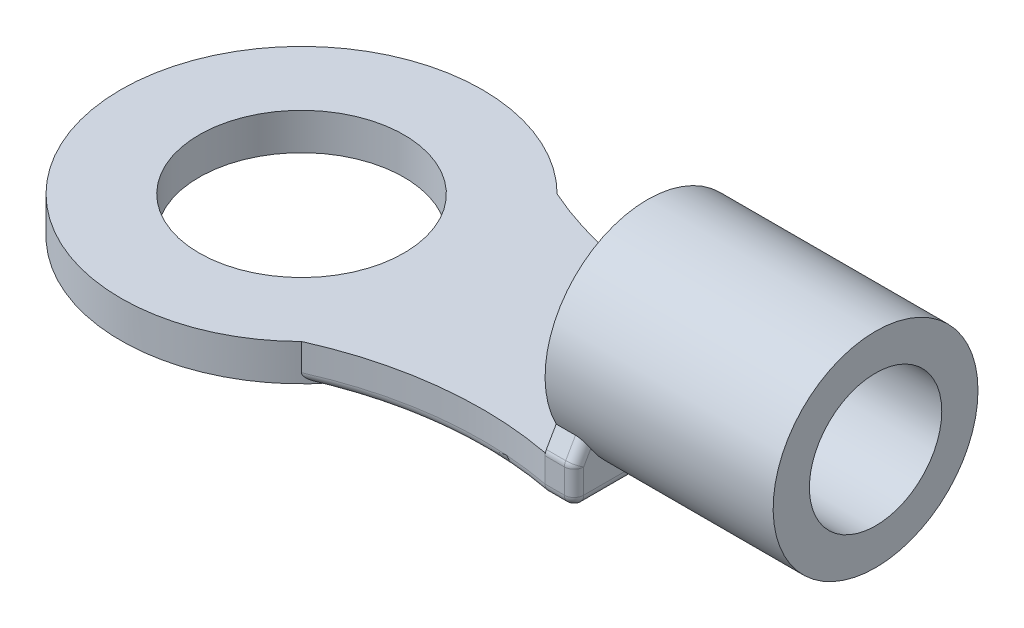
ISO-10303-21;
HEADER;
FILE_DESCRIPTION(('STEP AP214'),'2;1');
FILE_NAME('part.step','',(''),(''),'','','');
FILE_SCHEMA(('AUTOMOTIVE_DESIGN { 1 0 10303 214 1 1 1 1 }'));
ENDSEC;
DATA;
#1=APPLICATION_CONTEXT('core data for automotive mechanical design processes');
#2=APPLICATION_PROTOCOL_DEFINITION('international standard','automotive_design',2000,#1);
#3=PRODUCT_CONTEXT('',#1,'mechanical');
#4=PRODUCT('Part','Part','',(#3));
#5=PRODUCT_RELATED_PRODUCT_CATEGORY('part','',(#4));
#6=PRODUCT_DEFINITION_FORMATION('','',#4);
#7=PRODUCT_DEFINITION_CONTEXT('part definition',#1,'design');
#8=PRODUCT_DEFINITION('design','',#6,#7);
#9=PRODUCT_DEFINITION_SHAPE('','',#8);
#10=(LENGTH_UNIT() NAMED_UNIT(*) SI_UNIT(.MILLI.,.METRE.));
#11=(NAMED_UNIT(*) PLANE_ANGLE_UNIT() SI_UNIT($,.RADIAN.));
#12=(NAMED_UNIT(*) SI_UNIT($,.STERADIAN.) SOLID_ANGLE_UNIT());
#13=UNCERTAINTY_MEASURE_WITH_UNIT(LENGTH_MEASURE(1.E-05),#10,'distance_accuracy_value','');
#14=(GEOMETRIC_REPRESENTATION_CONTEXT(3) GLOBAL_UNCERTAINTY_ASSIGNED_CONTEXT((#13)) GLOBAL_UNIT_ASSIGNED_CONTEXT((#10,
#11,#12)) REPRESENTATION_CONTEXT('',''));
#15=CARTESIAN_POINT('',(0.,0.,0.));
#16=DIRECTION('',(0.,0.,1.));
#17=DIRECTION('',(1.,0.,0.));
#18=AXIS2_PLACEMENT_3D('',#15,#16,#17);
#19=CARTESIAN_POINT('',(9.85520000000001,0.,-2.69239999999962));
#20=DIRECTION('',(0.,0.,1.));
#21=DIRECTION('',(1.,0.,0.));
#22=AXIS2_PLACEMENT_3D('',#19,#20,#21);
#23=PLANE('',#22);
#24=DIRECTION('',(0.,1.,0.));
#25=VECTOR('',#24,1.);
#26=CARTESIAN_POINT('',(9.60120000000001,0.,-2.69240000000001));
#27=LINE('',#26,#25);
#28=CARTESIAN_POINT('',(9.60120000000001,0.897428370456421,-2.69240000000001));
#29=VERTEX_POINT('',#28);
#30=CARTESIAN_POINT('',(9.60120000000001,0.254000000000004,-2.69240000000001));
#31=VERTEX_POINT('',#30);
#32=EDGE_CURVE('E161',#29,#31,#27,.F.);
#33=ORIENTED_EDGE('',*,*,#32,.T.);
#34=DIRECTION('',(-1.,0.,0.));
#35=VECTOR('',#34,1.);
#36=CARTESIAN_POINT('',(9.85520000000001,0.254000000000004,-2.69239999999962));
#37=LINE('',#36,#35);
#38=CARTESIAN_POINT('',(9.09320000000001,0.254000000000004,-2.69240000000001));
#39=VERTEX_POINT('',#38);
#40=EDGE_CURVE('E219',#31,#39,#37,.T.);
#41=ORIENTED_EDGE('',*,*,#40,.T.);
#42=DIRECTION('',(0.,1.,0.));
#43=VECTOR('',#42,1.);
#44=CARTESIAN_POINT('',(9.09320000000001,0.,-2.69240000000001));
#45=LINE('',#44,#43);
#46=CARTESIAN_POINT('',(9.09320000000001,0.897428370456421,-2.69240000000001));
#47=VERTEX_POINT('',#46);
#48=EDGE_CURVE('E130',#39,#47,#45,.T.);
#49=ORIENTED_EDGE('',*,*,#48,.T.);
#50=DIRECTION('',(-1.,0.,0.));
#51=VECTOR('',#50,1.);
#52=CARTESIAN_POINT('',(9.85520000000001,0.897428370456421,-2.69239999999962));
#53=LINE('',#52,#51);
#54=EDGE_CURVE('E216',#47,#29,#53,.F.);
#55=ORIENTED_EDGE('',*,*,#54,.T.);
#56=EDGE_LOOP('',(#33,#41,#49,#55));
#57=FACE_BOUND('',#56,.T.);
#58=ADVANCED_FACE('F53',(#57),#23,.F.);
#59=CARTESIAN_POINT('',(9.85520000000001,0.965199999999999,-2.69239999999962));
#60=DIRECTION('',(0.,-0.49816942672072,0.867079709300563));
#61=DIRECTION('',(0.,-0.867079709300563,-0.498169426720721));
#62=AXIS2_PLACEMENT_3D('',#59,#60,#61);
#63=PLANE('',#62);
#64=DIRECTION('',(-1.,0.,0.));
#65=VECTOR('',#64,1.);
#66=CARTESIAN_POINT('',(9.8552,1.47319999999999,-2.40053517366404));
#67=LINE('',#66,#65);
#68=CARTESIAN_POINT('',(9.6012,1.47319999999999,-2.40053517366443));
#69=VERTEX_POINT('',#68);
#70=CARTESIAN_POINT('',(9.0932,1.47319999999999,-2.40053517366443));
#71=VERTEX_POINT('',#70);
#72=EDGE_CURVE('E123',#69,#71,#67,.T.);
#73=ORIENTED_EDGE('',*,*,#72,.F.);
#74=DIRECTION('',(0.,0.867079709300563,0.498169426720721));
#75=VECTOR('',#74,1.);
#76=CARTESIAN_POINT('',(9.60120000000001,1.40729506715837,-2.43840000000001));
#77=LINE('',#76,#75);
#78=CARTESIAN_POINT('',(9.60120000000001,1.02396340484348,-2.65863824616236));
#79=VERTEX_POINT('',#78);
#80=EDGE_CURVE('E213',#69,#79,#77,.F.);
#81=ORIENTED_EDGE('',*,*,#80,.T.);
#82=DIRECTION('',(-1.,0.,0.));
#83=VECTOR('',#82,1.);
#84=CARTESIAN_POINT('',(9.85520000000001,1.02396340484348,-2.65863824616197));
#85=LINE('',#84,#83);
#86=CARTESIAN_POINT('',(9.09320000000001,1.02396340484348,-2.65863824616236));
#87=VERTEX_POINT('',#86);
#88=EDGE_CURVE('E126',#79,#87,#85,.T.);
#89=ORIENTED_EDGE('',*,*,#88,.T.);
#90=DIRECTION('',(0.,0.867079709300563,0.49816942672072));
#91=VECTOR('',#90,1.);
#92=CARTESIAN_POINT('',(9.09320000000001,0.965199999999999,-2.69240000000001));
#93=LINE('',#92,#91);
#94=EDGE_CURVE('E120',#87,#71,#93,.T.);
#95=ORIENTED_EDGE('',*,*,#94,.T.);
#96=EDGE_LOOP('',(#73,#81,#89,#95));
#97=FACE_BOUND('',#96,.T.);
#98=ADVANCED_FACE('F122',(#97),#63,.F.);
#99=CARTESIAN_POINT('',(9.85520000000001,2.6924,3.88578058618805E-13));
#100=DIRECTION('',(-1.,0.,0.));
#101=DIRECTION('',(0.,0.,1.));
#102=AXIS2_PLACEMENT_3D('',#99,#100,#101);
#103=CYLINDRICAL_SURFACE('',#102,2.6924);
#104=CARTESIAN_POINT('',(9.85520000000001,2.6924,3.88578058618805E-13));
#105=DIRECTION('',(-1.,0.,0.));
#106=DIRECTION('',(0.,0.,-1.));
#107=AXIS2_PLACEMENT_3D('',#104,#105,#106);
#108=CIRCLE('',#107,2.6924);
#109=CARTESIAN_POINT('',(9.85520000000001,1.21914565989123,-2.25356149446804));
#110=VERTEX_POINT('',#109);
#111=CARTESIAN_POINT('',(9.8552,0.254000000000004,-1.14158801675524));
#112=VERTEX_POINT('',#111);
#113=EDGE_CURVE('E149',#110,#112,#108,.T.);
#114=ORIENTED_EDGE('',*,*,#113,.F.);
#115=CARTESIAN_POINT('',(9.85520000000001,1.21914565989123,-2.25356149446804));
#116=CARTESIAN_POINT('',(9.85520017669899,1.23428180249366,-2.26346487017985));
#117=CARTESIAN_POINT('',(9.85366448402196,1.24951965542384,-2.27320079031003));
#118=CARTESIAN_POINT('',(9.84761976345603,1.27978146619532,-2.29212473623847));
#119=CARTESIAN_POINT('',(9.843105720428,1.29480501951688,-2.3013118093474));
#120=CARTESIAN_POINT('',(9.83120159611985,1.32417124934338,-2.31889274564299));
#121=CARTESIAN_POINT('',(9.82381064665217,1.33851371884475,-2.32728636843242));
#122=CARTESIAN_POINT('',(9.80625264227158,1.36601644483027,-2.34306957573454));
#123=CARTESIAN_POINT('',(9.7960857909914,1.37917678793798,-2.35045923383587));
#124=CARTESIAN_POINT('',(9.77354074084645,1.40326784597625,-2.36375521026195));
#125=CARTESIAN_POINT('',(9.76125887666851,1.41426329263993,-2.36970648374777));
#126=CARTESIAN_POINT('',(9.73446974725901,1.43396602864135,-2.38022827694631));
#127=CARTESIAN_POINT('',(9.71996693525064,1.44267780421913,-2.38480150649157));
#128=CARTESIAN_POINT('',(9.69347405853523,1.45511639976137,-2.39127200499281));
#129=CARTESIAN_POINT('',(9.68190983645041,1.45955584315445,-2.39355983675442));
#130=CARTESIAN_POINT('',(9.65811651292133,1.46665173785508,-2.39720151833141));
#131=CARTESIAN_POINT('',(9.6458889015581,1.4693120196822,-2.39855737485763));
#132=CARTESIAN_POINT('',(9.62816186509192,1.47173312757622,-2.39978971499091));
#133=CARTESIAN_POINT('',(9.6227866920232,1.47228255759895,-2.40006904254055));
#134=CARTESIAN_POINT('',(9.61200859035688,1.47301590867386,-2.40044169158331));
#135=CARTESIAN_POINT('',(9.606605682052,1.47320006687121,-2.40053513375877));
#136=CARTESIAN_POINT('',(9.6012,1.47319999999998,-2.40053517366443));
#137=B_SPLINE_CURVE_WITH_KNOTS('',3,(#115,#116,#117,#118,#119,#120,#121,#122,#123,#124,#125,
#126,#127,#128,#129,#130,#131,#132,#133,#134,#135,#136),.UNSPECIFIED.,.F.,.F.,(4,2,2,2,2,2,2,2,
2,2,4),(0.,0.0541913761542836,0.108474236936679,0.162773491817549,0.21706876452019,
0.269344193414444,0.321516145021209,0.359150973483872,0.396704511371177,0.412922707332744,
0.429130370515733),.UNSPECIFIED.);
#138=EDGE_CURVE('E137',#110,#69,#137,.T.);
#139=ORIENTED_EDGE('',*,*,#138,.T.);
#140=ORIENTED_EDGE('',*,*,#72,.T.);
#141=CARTESIAN_POINT('',(9.09320000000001,2.6924,0.));
#142=DIRECTION('',(-1.,0.,0.));
#143=DIRECTION('',(0.,0.,-1.));
#144=AXIS2_PLACEMENT_3D('',#141,#142,#143);
#145=CIRCLE('',#144,2.6924);
#146=CARTESIAN_POINT('',(9.09320000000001,0.,0.));
#147=VERTEX_POINT('',#146);
#148=EDGE_CURVE('E129',#71,#147,#145,.T.);
#149=ORIENTED_EDGE('',*,*,#148,.T.);
#150=DIRECTION('',(-1.,0.,0.));
#151=VECTOR('',#150,1.);
#152=CARTESIAN_POINT('',(9.85520000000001,0.,3.88578058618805E-13));
#153=LINE('',#152,#151);
#154=CARTESIAN_POINT('',(9.60120000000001,0.,0.));
#155=VERTEX_POINT('',#154);
#156=EDGE_CURVE('E140',#155,#147,#153,.T.);
#157=ORIENTED_EDGE('',*,*,#156,.F.);
#158=CARTESIAN_POINT('',(9.8552,0.254000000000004,-1.14158801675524));
#159=CARTESIAN_POINT('',(9.85519619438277,0.24489021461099,-1.12213057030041));
#160=CARTESIAN_POINT('',(9.85471041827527,0.236016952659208,-1.10257018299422));
#161=CARTESIAN_POINT('',(9.85289357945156,0.218757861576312,-1.06328362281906));
#162=CARTESIAN_POINT('',(9.85156288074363,0.210371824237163,-1.04355752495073));
#163=CARTESIAN_POINT('',(9.84648737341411,0.185987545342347,-0.984245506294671));
#164=CARTESIAN_POINT('',(9.84165817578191,0.170726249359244,-0.944446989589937));
#165=CARTESIAN_POINT('',(9.82981991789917,0.142261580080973,-0.864639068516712));
#166=CARTESIAN_POINT('',(9.82281960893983,0.1290502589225,-0.824631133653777));
#167=CARTESIAN_POINT('',(9.80712167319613,0.104591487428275,-0.744330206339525));
#168=CARTESIAN_POINT('',(9.79842300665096,0.0933452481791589,-0.704037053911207));
#169=CARTESIAN_POINT('',(9.76408395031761,0.0555794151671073,-0.555551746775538));
#170=CARTESIAN_POINT('',(9.73447924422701,0.0350441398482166,-0.446719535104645));
#171=CARTESIAN_POINT('',(9.67134151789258,0.00746258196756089,-0.228538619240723));
#172=CARTESIAN_POINT('',(9.63780728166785,0.000420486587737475,-0.119189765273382));
#173=CARTESIAN_POINT('',(9.60323130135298,6.10381460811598E-06,-0.00661345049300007));
#174=CARTESIAN_POINT('',(9.60221563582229,1.2847745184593E-08,-0.00330668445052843));
#175=CARTESIAN_POINT('',(9.60120000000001,0.,0.));
#176=B_SPLINE_CURVE_WITH_KNOTS('',3,(#158,#159,#160,#161,#162,#163,#164,#165,#166,#167,#168,
#169,#170,#171,#172,#173,#174,#175),.UNSPECIFIED.,.F.,.F.,(4,2,2,2,2,2,2,2,4),(0.,
0.064435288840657,0.128842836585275,0.257397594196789,0.385440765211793,0.513562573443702,
0.85637106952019,1.19928592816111,1.20966361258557),.UNSPECIFIED.);
#177=EDGE_CURVE('E168',#155,#112,#176,.F.);
#178=ORIENTED_EDGE('',*,*,#177,.T.);
#179=EDGE_LOOP('',(#114,#139,#140,#149,#157,#178));
#180=FACE_BOUND('',#179,.T.);
#181=ADVANCED_FACE('F135',(#180),#103,.F.);
#182=CARTESIAN_POINT('',(9.85520000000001,0.,-2.69239999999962));
#183=DIRECTION('',(0.,1.,0.));
#184=DIRECTION('',(0.,0.,1.));
#185=AXIS2_PLACEMENT_3D('',#182,#183,#184);
#186=PLANE('',#185);
#187=DIRECTION('',(0.,0.,-1.));
#188=VECTOR('',#187,1.);
#189=CARTESIAN_POINT('',(9.09320000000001,0.,-2.69240000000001));
#190=LINE('',#189,#188);
#191=CARTESIAN_POINT('',(9.09320000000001,0.,-2.43840000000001));
#192=VERTEX_POINT('',#191);
#193=EDGE_CURVE('E143',#147,#192,#190,.T.);
#194=ORIENTED_EDGE('',*,*,#193,.T.);
#195=DIRECTION('',(-1.,0.,0.));
#196=VECTOR('',#195,1.);
#197=CARTESIAN_POINT('',(9.85520000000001,0.,-2.43839999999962));
#198=LINE('',#197,#196);
#199=CARTESIAN_POINT('',(9.60120000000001,0.,-2.43840000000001));
#200=VERTEX_POINT('',#199);
#201=EDGE_CURVE('E12',#192,#200,#198,.F.);
#202=ORIENTED_EDGE('',*,*,#201,.T.);
#203=DIRECTION('',(0.,0.,-1.));
#204=VECTOR('',#203,1.);
#205=CARTESIAN_POINT('',(9.60120000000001,0.,0.));
#206=LINE('',#205,#204);
#207=EDGE_CURVE('E165',#200,#155,#206,.F.);
#208=ORIENTED_EDGE('',*,*,#207,.T.);
#209=ORIENTED_EDGE('',*,*,#156,.T.);
#210=EDGE_LOOP('',(#194,#202,#208,#209));
#211=FACE_BOUND('',#210,.T.);
#212=ADVANCED_FACE('F266',(#211),#186,.F.);
#213=CARTESIAN_POINT('',(9.85520000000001,2.6924,3.88578058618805E-13));
#214=DIRECTION('',(1.,0.,0.));
#215=DIRECTION('',(0.,0.,-1.));
#216=AXIS2_PLACEMENT_3D('',#213,#214,#215);
#217=PLANE('',#216);
#218=DIRECTION('',(0.,1.,0.));
#219=VECTOR('',#218,1.);
#220=CARTESIAN_POINT('',(9.85520000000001,0.965199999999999,-2.43839999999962));
#221=LINE('',#220,#219);
#222=CARTESIAN_POINT('',(9.85520000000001,0.254000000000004,-2.43839999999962));
#223=VERTEX_POINT('',#222);
#224=CARTESIAN_POINT('',(9.85520000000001,0.897428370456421,-2.43839999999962));
#225=VERTEX_POINT('',#224);
#226=EDGE_CURVE('E157',#223,#225,#221,.T.);
#227=ORIENTED_EDGE('',*,*,#226,.T.);
#228=DIRECTION('',(0.,0.867079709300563,0.498169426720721));
#229=VECTOR('',#228,1.);
#230=CARTESIAN_POINT('',(9.85520000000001,1.34666496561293,-2.18029692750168));
#231=LINE('',#230,#229);
#232=EDGE_CURVE('E209',#225,#110,#231,.T.);
#233=ORIENTED_EDGE('',*,*,#232,.T.);
#234=ORIENTED_EDGE('',*,*,#113,.T.);
#235=DIRECTION('',(0.,0.,-1.));
#236=VECTOR('',#235,1.);
#237=CARTESIAN_POINT('',(9.85520000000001,0.254000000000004,-2.69239999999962));
#238=LINE('',#237,#236);
#239=EDGE_CURVE('E139',#112,#223,#238,.T.);
#240=ORIENTED_EDGE('',*,*,#239,.T.);
#241=EDGE_LOOP('',(#227,#233,#234,#240));
#242=FACE_BOUND('',#241,.T.);
#243=ADVANCED_FACE('F257',(#242),#217,.T.);
#244=CARTESIAN_POINT('',(9.09320000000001,2.6924,0.));
#245=DIRECTION('',(1.,0.,0.));
#246=DIRECTION('',(0.,0.,-1.));
#247=AXIS2_PLACEMENT_3D('',#244,#245,#246);
#248=PLANE('',#247);
#249=ORIENTED_EDGE('',*,*,#48,.F.);
#250=CARTESIAN_POINT('',(9.09320000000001,0.254000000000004,-2.43840000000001));
#251=DIRECTION('',(1.,0.,0.));
#252=DIRECTION('',(0.,0.,-1.));
#253=AXIS2_PLACEMENT_3D('',#250,#251,#252);
#254=CIRCLE('',#253,0.254);
#255=EDGE_CURVE('E63',#39,#192,#254,.F.);
#256=ORIENTED_EDGE('',*,*,#255,.T.);
#257=ORIENTED_EDGE('',*,*,#193,.F.);
#258=ORIENTED_EDGE('',*,*,#148,.F.);
#259=ORIENTED_EDGE('',*,*,#94,.F.);
#260=CARTESIAN_POINT('',(9.09320000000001,0.897428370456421,-2.43840000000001));
#261=DIRECTION('',(1.,0.,0.));
#262=DIRECTION('',(0.,0.,-1.));
#263=AXIS2_PLACEMENT_3D('',#260,#261,#262);
#264=CIRCLE('',#263,0.254);
#265=EDGE_CURVE('E76',#87,#47,#264,.F.);
#266=ORIENTED_EDGE('',*,*,#265,.T.);
#267=EDGE_LOOP('',(#249,#256,#257,#258,#259,#266));
#268=FACE_BOUND('',#267,.T.);
#269=ADVANCED_FACE('F142',(#268),#248,.F.);
#270=CARTESIAN_POINT('',(9.60120000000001,0.254000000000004,0.));
#271=DIRECTION('',(0.,0.,1.));
#272=DIRECTION('',(1.,0.,0.));
#273=AXIS2_PLACEMENT_3D('',#270,#271,#272);
#274=CYLINDRICAL_SURFACE('',#273,0.254);
#275=ORIENTED_EDGE('',*,*,#207,.F.);
#276=CARTESIAN_POINT('',(9.60120000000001,0.254000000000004,-2.43840000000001));
#277=DIRECTION('',(0.,0.,1.));
#278=DIRECTION('',(1.,0.,0.));
#279=AXIS2_PLACEMENT_3D('',#276,#277,#278);
#280=CIRCLE('',#279,0.254);
#281=EDGE_CURVE('E249',#200,#223,#280,.T.);
#282=ORIENTED_EDGE('',*,*,#281,.T.);
#283=ORIENTED_EDGE('',*,*,#239,.F.);
#284=ORIENTED_EDGE('',*,*,#177,.F.);
#285=EDGE_LOOP('',(#275,#282,#283,#284));
#286=FACE_BOUND('',#285,.T.);
#287=ADVANCED_FACE('F182',(#286),#274,.T.);
#288=CARTESIAN_POINT('',(9.60120000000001,2.6924,-2.43840000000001));
#289=DIRECTION('',(0.,-1.,0.));
#290=DIRECTION('',(0.,0.,-1.));
#291=AXIS2_PLACEMENT_3D('',#288,#289,#290);
#292=CYLINDRICAL_SURFACE('',#291,0.254);
#293=ORIENTED_EDGE('',*,*,#226,.F.);
#294=CARTESIAN_POINT('',(9.60120000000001,0.254000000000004,-2.43840000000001));
#295=DIRECTION('',(0.,-1.,0.));
#296=DIRECTION('',(0.,0.,-1.));
#297=AXIS2_PLACEMENT_3D('',#294,#295,#296);
#298=CIRCLE('',#297,0.254);
#299=EDGE_CURVE('E246',#223,#31,#298,.F.);
#300=ORIENTED_EDGE('',*,*,#299,.T.);
#301=ORIENTED_EDGE('',*,*,#32,.F.);
#302=CARTESIAN_POINT('',(9.60120000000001,0.897428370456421,-2.43840000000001));
#303=DIRECTION('',(0.,-1.,0.));
#304=DIRECTION('',(0.,0.,-1.));
#305=AXIS2_PLACEMENT_3D('',#302,#303,#304);
#306=CIRCLE('',#305,0.254);
#307=EDGE_CURVE('E177',#29,#225,#306,.T.);
#308=ORIENTED_EDGE('',*,*,#307,.T.);
#309=EDGE_LOOP('',(#293,#300,#301,#308));
#310=FACE_BOUND('',#309,.T.);
#311=ADVANCED_FACE('F187',(#310),#292,.T.);
#312=CARTESIAN_POINT('',(9.85520000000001,0.254000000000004,-2.43839999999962));
#313=DIRECTION('',(-1.,0.,0.));
#314=DIRECTION('',(0.,0.,1.));
#315=AXIS2_PLACEMENT_3D('',#312,#313,#314);
#316=CYLINDRICAL_SURFACE('',#315,0.254);
#317=ORIENTED_EDGE('',*,*,#255,.F.);
#318=ORIENTED_EDGE('',*,*,#40,.F.);
#319=CARTESIAN_POINT('',(9.60120000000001,0.254000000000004,-2.43840000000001));
#320=DIRECTION('',(1.,0.,0.));
#321=DIRECTION('',(0.,0.,-1.));
#322=AXIS2_PLACEMENT_3D('',#319,#320,#321);
#323=CIRCLE('',#322,0.254);
#324=EDGE_CURVE('E226',#200,#31,#323,.T.);
#325=ORIENTED_EDGE('',*,*,#324,.F.);
#326=ORIENTED_EDGE('',*,*,#201,.F.);
#327=EDGE_LOOP('',(#317,#318,#325,#326));
#328=FACE_BOUND('',#327,.T.);
#329=ADVANCED_FACE('F193',(#328),#316,.T.);
#330=CARTESIAN_POINT('',(9.60120000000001,0.254000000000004,-2.43840000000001));
#331=DIRECTION('',(0.,0.,1.));
#332=DIRECTION('',(1.,0.,0.));
#333=AXIS2_PLACEMENT_3D('',#330,#331,#332);
#334=SPHERICAL_SURFACE('',#333,0.254);
#335=ORIENTED_EDGE('',*,*,#299,.F.);
#336=ORIENTED_EDGE('',*,*,#281,.F.);
#337=ORIENTED_EDGE('',*,*,#324,.T.);
#338=EDGE_LOOP('',(#335,#336,#337));
#339=FACE_BOUND('',#338,.T.);
#340=ADVANCED_FACE('F190',(#339),#334,.T.);
#341=CARTESIAN_POINT('',(9.85520000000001,0.897428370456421,-2.43839999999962));
#342=DIRECTION('',(-1.,0.,0.));
#343=DIRECTION('',(0.,0.,1.));
#344=AXIS2_PLACEMENT_3D('',#341,#342,#343);
#345=CYLINDRICAL_SURFACE('',#344,0.254);
#346=CARTESIAN_POINT('',(9.60120000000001,0.897428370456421,-2.43840000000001));
#347=DIRECTION('',(1.,0.,0.));
#348=DIRECTION('',(0.,0.,-1.));
#349=AXIS2_PLACEMENT_3D('',#346,#347,#348);
#350=CIRCLE('',#349,0.254);
#351=EDGE_CURVE('E57',#29,#79,#350,.T.);
#352=ORIENTED_EDGE('',*,*,#351,.F.);
#353=ORIENTED_EDGE('',*,*,#54,.F.);
#354=ORIENTED_EDGE('',*,*,#265,.F.);
#355=ORIENTED_EDGE('',*,*,#88,.F.);
#356=EDGE_LOOP('',(#352,#353,#354,#355));
#357=FACE_BOUND('',#356,.T.);
#358=ADVANCED_FACE('F55',(#357),#345,.T.);
#359=CARTESIAN_POINT('',(9.60120000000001,0.897428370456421,-2.43840000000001));
#360=DIRECTION('',(0.,-0.49816942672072,0.867079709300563));
#361=DIRECTION('',(0.,-0.867079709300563,-0.498169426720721));
#362=AXIS2_PLACEMENT_3D('',#359,#360,#361);
#363=SPHERICAL_SURFACE('',#362,0.254);
#364=ORIENTED_EDGE('',*,*,#307,.F.);
#365=ORIENTED_EDGE('',*,*,#351,.T.);
#366=CARTESIAN_POINT('',(9.60120000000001,0.897428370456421,-2.43840000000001));
#367=DIRECTION('',(0.,0.867079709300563,0.498169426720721));
#368=DIRECTION('',(0.,-0.498169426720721,0.867079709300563));
#369=AXIS2_PLACEMENT_3D('',#366,#367,#368);
#370=CIRCLE('',#369,0.254);
#371=EDGE_CURVE('E228',#225,#79,#370,.T.);
#372=ORIENTED_EDGE('',*,*,#371,.F.);
#373=EDGE_LOOP('',(#364,#365,#372));
#374=FACE_BOUND('',#373,.T.);
#375=ADVANCED_FACE('F201',(#374),#363,.T.);
#376=CARTESIAN_POINT('',(9.60120000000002,3.30021012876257,-1.0579128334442));
#377=DIRECTION('',(0.,-0.867079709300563,-0.498169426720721));
#378=DIRECTION('',(0.,0.49816942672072,-0.867079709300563));
#379=AXIS2_PLACEMENT_3D('',#376,#377,#378);
#380=CYLINDRICAL_SURFACE('',#379,0.254);
#381=ORIENTED_EDGE('',*,*,#371,.T.);
#382=ORIENTED_EDGE('',*,*,#80,.F.);
#383=ORIENTED_EDGE('',*,*,#138,.F.);
#384=ORIENTED_EDGE('',*,*,#232,.F.);
#385=EDGE_LOOP('',(#381,#382,#383,#384));
#386=FACE_BOUND('',#385,.T.);
#387=ADVANCED_FACE('F198',(#386),#380,.T.);
#388=CLOSED_SHELL('',(#58,#98,#181,#212,#243,#269,#287,#311,#329,#340,#358,#375,#387));
#389=MANIFOLD_SOLID_BREP('B2',#388);
#390=CARTESIAN_POINT('',(9.85520000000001,0.965199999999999,2.69240000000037));
#391=DIRECTION('',(0.,-0.49816942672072,-0.867079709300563));
#392=DIRECTION('',(0.,0.867079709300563,-0.49816942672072));
#393=AXIS2_PLACEMENT_3D('',#390,#391,#392);
#394=PLANE('',#393);
#395=DIRECTION('',(0.,-0.867079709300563,0.49816942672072));
#396=VECTOR('',#395,1.);
#397=CARTESIAN_POINT('',(9.09320000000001,0.965199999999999,2.69239999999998));
#398=LINE('',#397,#396);
#399=CARTESIAN_POINT('',(9.09320000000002,1.47319999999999,2.4005351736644));
#400=VERTEX_POINT('',#399);
#401=CARTESIAN_POINT('',(9.09320000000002,1.02396340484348,2.65863824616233));
#402=VERTEX_POINT('',#401);
#403=EDGE_CURVE('E478',#400,#402,#398,.T.);
#404=ORIENTED_EDGE('',*,*,#403,.T.);
#405=DIRECTION('',(-1.,0.,0.));
#406=VECTOR('',#405,1.);
#407=CARTESIAN_POINT('',(9.85520000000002,1.02396340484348,2.65863824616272));
#408=LINE('',#407,#406);
#409=CARTESIAN_POINT('',(9.60120000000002,1.02396340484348,2.65863824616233));
#410=VERTEX_POINT('',#409);
#411=EDGE_CURVE('E502',#402,#410,#408,.F.);
#412=ORIENTED_EDGE('',*,*,#411,.T.);
#413=DIRECTION('',(0.,-0.867079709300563,0.49816942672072));
#414=VECTOR('',#413,1.);
#415=CARTESIAN_POINT('',(9.60120000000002,1.47319999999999,2.4005351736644));
#416=LINE('',#415,#414);
#417=CARTESIAN_POINT('',(9.60120000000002,1.47319999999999,2.4005351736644));
#418=VERTEX_POINT('',#417);
#419=EDGE_CURVE('E499',#410,#418,#416,.F.);
#420=ORIENTED_EDGE('',*,*,#419,.T.);
#421=DIRECTION('',(-1.,0.,0.));
#422=VECTOR('',#421,1.);
#423=CARTESIAN_POINT('',(9.85520000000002,1.47319999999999,2.40053517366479));
#424=LINE('',#423,#422);
#425=EDGE_CURVE('E474',#418,#400,#424,.T.);
#426=ORIENTED_EDGE('',*,*,#425,.T.);
#427=EDGE_LOOP('',(#404,#412,#420,#426));
#428=FACE_BOUND('',#427,.T.);
#429=ADVANCED_FACE('F387',(#428),#394,.F.);
#430=CARTESIAN_POINT('',(9.85520000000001,0.965199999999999,2.69240000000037));
#431=DIRECTION('',(0.,0.,-1.));
#432=DIRECTION('',(-1.,0.,0.));
#433=AXIS2_PLACEMENT_3D('',#430,#431,#432);
#434=PLANE('',#433);
#435=DIRECTION('',(0.,-1.,0.));
#436=VECTOR('',#435,1.);
#437=CARTESIAN_POINT('',(9.09320000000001,0.965199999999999,2.69239999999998));
#438=LINE('',#437,#436);
#439=CARTESIAN_POINT('',(9.09320000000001,0.897428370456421,2.69239999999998));
#440=VERTEX_POINT('',#439);
#441=CARTESIAN_POINT('',(9.09320000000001,0.254000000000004,2.69239999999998));
#442=VERTEX_POINT('',#441);
#443=EDGE_CURVE('E463',#440,#442,#438,.T.);
#444=ORIENTED_EDGE('',*,*,#443,.T.);
#445=DIRECTION('',(-1.,0.,0.));
#446=VECTOR('',#445,1.);
#447=CARTESIAN_POINT('',(9.85520000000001,0.254000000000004,2.69240000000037));
#448=LINE('',#447,#446);
#449=CARTESIAN_POINT('',(9.60120000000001,0.254000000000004,2.69239999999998));
#450=VERTEX_POINT('',#449);
#451=EDGE_CURVE('E51',#442,#450,#448,.F.);
#452=ORIENTED_EDGE('',*,*,#451,.T.);
#453=DIRECTION('',(0.,-1.,0.));
#454=VECTOR('',#453,1.);
#455=CARTESIAN_POINT('',(9.60120000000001,0.965199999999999,2.69239999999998));
#456=LINE('',#455,#454);
#457=CARTESIAN_POINT('',(9.60120000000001,0.897428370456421,2.69239999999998));
#458=VERTEX_POINT('',#457);
#459=EDGE_CURVE('E473',#450,#458,#456,.F.);
#460=ORIENTED_EDGE('',*,*,#459,.T.);
#461=DIRECTION('',(-1.,0.,0.));
#462=VECTOR('',#461,1.);
#463=CARTESIAN_POINT('',(9.85520000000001,0.897428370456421,2.69240000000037));
#464=LINE('',#463,#462);
#465=EDGE_CURVE('E492',#458,#440,#464,.T.);
#466=ORIENTED_EDGE('',*,*,#465,.T.);
#467=EDGE_LOOP('',(#444,#452,#460,#466));
#468=FACE_BOUND('',#467,.T.);
#469=ADVANCED_FACE('F557',(#468),#434,.F.);
#470=CARTESIAN_POINT('',(9.85520000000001,0.,2.69240000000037));
#471=DIRECTION('',(0.,1.,0.));
#472=DIRECTION('',(0.,0.,1.));
#473=AXIS2_PLACEMENT_3D('',#470,#471,#472);
#474=PLANE('',#473);
#475=DIRECTION('',(-1.,0.,0.));
#476=VECTOR('',#475,1.);
#477=CARTESIAN_POINT('',(9.85520000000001,0.,3.88578058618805E-13));
#478=LINE('',#477,#476);
#479=CARTESIAN_POINT('',(9.60120000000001,0.,0.));
#480=VERTEX_POINT('',#479);
#481=CARTESIAN_POINT('',(9.09320000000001,0.,0.));
#482=VERTEX_POINT('',#481);
#483=EDGE_CURVE('E456',#480,#482,#478,.T.);
#484=ORIENTED_EDGE('',*,*,#483,.F.);
#485=DIRECTION('',(0.,0.,-1.));
#486=VECTOR('',#485,1.);
#487=CARTESIAN_POINT('',(9.60120000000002,0.,2.43839999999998));
#488=LINE('',#487,#486);
#489=CARTESIAN_POINT('',(9.60120000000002,0.,2.43839999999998));
#490=VERTEX_POINT('',#489);
#491=EDGE_CURVE('E591',#480,#490,#488,.F.);
#492=ORIENTED_EDGE('',*,*,#491,.T.);
#493=DIRECTION('',(-1.,0.,0.));
#494=VECTOR('',#493,1.);
#495=CARTESIAN_POINT('',(9.85520000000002,0.,2.43840000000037));
#496=LINE('',#495,#494);
#497=CARTESIAN_POINT('',(9.09320000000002,0.,2.43839999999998));
#498=VERTEX_POINT('',#497);
#499=EDGE_CURVE('E459',#490,#498,#496,.T.);
#500=ORIENTED_EDGE('',*,*,#499,.T.);
#501=DIRECTION('',(0.,0.,-1.));
#502=VECTOR('',#501,1.);
#503=CARTESIAN_POINT('',(9.09320000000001,0.,2.69239999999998));
#504=LINE('',#503,#502);
#505=EDGE_CURVE('E453',#498,#482,#504,.T.);
#506=ORIENTED_EDGE('',*,*,#505,.T.);
#507=EDGE_LOOP('',(#484,#492,#500,#506));
#508=FACE_BOUND('',#507,.T.);
#509=ADVANCED_FACE('F455',(#508),#474,.F.);
#510=CARTESIAN_POINT('',(9.85520000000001,2.6924,3.88578058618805E-13));
#511=DIRECTION('',(-1.,0.,0.));
#512=DIRECTION('',(0.,0.,1.));
#513=AXIS2_PLACEMENT_3D('',#510,#511,#512);
#514=CYLINDRICAL_SURFACE('',#513,2.6924);
#515=CARTESIAN_POINT('',(9.85520000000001,2.6924,3.88578058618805E-13));
#516=DIRECTION('',(-1.,0.,0.));
#517=DIRECTION('',(0.,0.,-1.));
#518=AXIS2_PLACEMENT_3D('',#515,#516,#517);
#519=CIRCLE('',#518,2.6924);
#520=CARTESIAN_POINT('',(9.85520000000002,0.254000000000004,1.14158801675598));
#521=VERTEX_POINT('',#520);
#522=CARTESIAN_POINT('',(9.85520000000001,1.21914565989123,2.25356149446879));
#523=VERTEX_POINT('',#522);
#524=EDGE_CURVE('E480',#521,#523,#519,.T.);
#525=ORIENTED_EDGE('',*,*,#524,.F.);
#526=CARTESIAN_POINT('',(9.85520000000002,0.254000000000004,1.14158801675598));
#527=CARTESIAN_POINT('',(9.85519619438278,0.244890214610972,1.12213057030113));
#528=CARTESIAN_POINT('',(9.85471041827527,0.236016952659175,1.10257018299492));
#529=CARTESIAN_POINT('',(9.85289357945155,0.218757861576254,1.0632836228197));
#530=CARTESIAN_POINT('',(9.85156288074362,0.210371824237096,1.04355752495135));
#531=CARTESIAN_POINT('',(9.84648737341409,0.185987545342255,0.984245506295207));
#532=CARTESIAN_POINT('',(9.84165817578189,0.170726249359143,0.944446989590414));
#533=CARTESIAN_POINT('',(9.82981991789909,0.142261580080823,0.864639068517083));
#534=CARTESIAN_POINT('',(9.82281960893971,0.129050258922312,0.824631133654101));
#535=CARTESIAN_POINT('',(9.80712167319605,0.10459148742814,0.744330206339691));
#536=CARTESIAN_POINT('',(9.79842300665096,0.0933452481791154,0.704037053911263));
#537=CARTESIAN_POINT('',(9.76408395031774,0.0555794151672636,0.555551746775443));
#538=CARTESIAN_POINT('',(9.73447924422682,0.0350441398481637,0.446719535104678));
#539=CARTESIAN_POINT('',(9.67134151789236,0.00746258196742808,0.228538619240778));
#540=CARTESIAN_POINT('',(9.63780728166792,0.000420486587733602,0.119189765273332));
#541=CARTESIAN_POINT('',(9.60323130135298,6.10381460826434E-06,0.00661345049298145));
#542=CARTESIAN_POINT('',(9.60221563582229,1.28477453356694E-08,0.00330668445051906));
#543=CARTESIAN_POINT('',(9.60120000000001,0.,0.));
#544=B_SPLINE_CURVE_WITH_KNOTS('',3,(#526,#527,#528,#529,#530,#531,#532,#533,#534,#535,#536,
#537,#538,#539,#540,#541,#542,#543),.UNSPECIFIED.,.F.,.F.,(4,2,2,2,2,2,2,2,4),(0.,
0.064435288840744,0.128842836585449,0.257397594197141,0.385440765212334,0.513562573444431,
0.856371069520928,1.19928592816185,1.20966361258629),.UNSPECIFIED.);
#545=EDGE_CURVE('E471',#521,#480,#544,.T.);
#546=ORIENTED_EDGE('',*,*,#545,.T.);
#547=ORIENTED_EDGE('',*,*,#483,.T.);
#548=CARTESIAN_POINT('',(9.09320000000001,2.6924,0.));
#549=DIRECTION('',(-1.,0.,0.));
#550=DIRECTION('',(0.,0.,-1.));
#551=AXIS2_PLACEMENT_3D('',#548,#549,#550);
#552=CIRCLE('',#551,2.6924);
#553=EDGE_CURVE('E462',#482,#400,#552,.T.);
#554=ORIENTED_EDGE('',*,*,#553,.T.);
#555=ORIENTED_EDGE('',*,*,#425,.F.);
#556=CARTESIAN_POINT('',(9.60120000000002,1.47319999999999,2.4005351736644));
#557=CARTESIAN_POINT('',(9.61392720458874,1.47322124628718,2.40054301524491));
#558=CARTESIAN_POINT('',(9.62663478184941,1.47218214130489,2.400018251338));
#559=CARTESIAN_POINT('',(9.65158683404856,1.46815951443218,2.39797032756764));
#560=CARTESIAN_POINT('',(9.66383346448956,1.4651866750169,2.39645265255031));
#561=CARTESIAN_POINT('',(9.68756980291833,1.45747500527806,2.39248730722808));
#562=CARTESIAN_POINT('',(9.6990605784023,1.45273873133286,2.39004098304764));
#563=CARTESIAN_POINT('',(9.72107561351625,1.44175067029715,2.3843096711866));
#564=CARTESIAN_POINT('',(9.73159868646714,1.43549705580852,2.3810236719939));
#565=CARTESIAN_POINT('',(9.75218904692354,1.4212647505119,2.37345781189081));
#566=CARTESIAN_POINT('',(9.76217484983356,1.41319683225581,2.36912503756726));
#567=CARTESIAN_POINT('',(9.78072085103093,1.39593721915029,2.35972428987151));
#568=CARTESIAN_POINT('',(9.78928061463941,1.38674518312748,2.35465609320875));
#569=CARTESIAN_POINT('',(9.80611406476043,1.36601054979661,2.3430472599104));
#570=CARTESIAN_POINT('',(9.81413779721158,1.3543244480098,2.3364001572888));
#571=CARTESIAN_POINT('',(9.8281121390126,1.33016024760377,2.3223945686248));
#572=CARTESIAN_POINT('',(9.83406110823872,1.31768153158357,2.31503552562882));
#573=CARTESIAN_POINT('',(9.84430126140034,1.2909782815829,2.29897774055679));
#574=CARTESIAN_POINT('',(9.8483682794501,1.2767036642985,2.29021856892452));
#575=CARTESIAN_POINT('',(9.85381707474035,1.24797000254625,2.27220933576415));
#576=CARTESIAN_POINT('',(9.85520097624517,1.23351111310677,2.26295966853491));
#577=CARTESIAN_POINT('',(9.85520000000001,1.21914565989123,2.25356149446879));
#578=B_SPLINE_CURVE_WITH_KNOTS('',3,(#556,#557,#558,#559,#560,#561,#562,#563,#564,#565,#566,
#567,#568,#569,#570,#571,#572,#573,#574,#575,#576,#577),.UNSPECIFIED.,.F.,.F.,(4,2,2,2,2,2,2,2,
2,2,4),(0.,0.0380975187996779,0.0759863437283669,0.11382045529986,0.151700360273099,
0.192192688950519,0.23269733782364,0.279479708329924,0.32629897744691,0.377782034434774,
0.42922431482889),.UNSPECIFIED.);
#579=EDGE_CURVE('E512',#418,#523,#578,.T.);
#580=ORIENTED_EDGE('',*,*,#579,.T.);
#581=EDGE_LOOP('',(#525,#546,#547,#554,#555,#580));
#582=FACE_BOUND('',#581,.T.);
#583=ADVANCED_FACE('F468',(#582),#514,.F.);
#584=CARTESIAN_POINT('',(9.85520000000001,2.6924,3.88578058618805E-13));
#585=DIRECTION('',(1.,0.,0.));
#586=DIRECTION('',(0.,0.,-1.));
#587=AXIS2_PLACEMENT_3D('',#584,#585,#586);
#588=PLANE('',#587);
#589=DIRECTION('',(0.,-1.,0.));
#590=VECTOR('',#589,1.);
#591=CARTESIAN_POINT('',(9.85520000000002,0.,2.43840000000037));
#592=LINE('',#591,#590);
#593=CARTESIAN_POINT('',(9.85520000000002,0.897428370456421,2.43840000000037));
#594=VERTEX_POINT('',#593);
#595=CARTESIAN_POINT('',(9.85520000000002,0.254000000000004,2.43840000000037));
#596=VERTEX_POINT('',#595);
#597=EDGE_CURVE('E505',#594,#596,#592,.T.);
#598=ORIENTED_EDGE('',*,*,#597,.T.);
#599=DIRECTION('',(0.,0.,-1.));
#600=VECTOR('',#599,1.);
#601=CARTESIAN_POINT('',(9.85520000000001,0.254000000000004,3.88578058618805E-13));
#602=LINE('',#601,#600);
#603=EDGE_CURVE('E520',#596,#521,#602,.T.);
#604=ORIENTED_EDGE('',*,*,#603,.T.);
#605=ORIENTED_EDGE('',*,*,#524,.T.);
#606=DIRECTION('',(0.,-0.867079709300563,0.49816942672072));
#607=VECTOR('',#606,1.);
#608=CARTESIAN_POINT('',(9.85520000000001,0.83866496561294,2.47216175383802));
#609=LINE('',#608,#607);
#610=EDGE_CURVE('E509',#523,#594,#609,.T.);
#611=ORIENTED_EDGE('',*,*,#610,.T.);
#612=EDGE_LOOP('',(#598,#604,#605,#611));
#613=FACE_BOUND('',#612,.T.);
#614=ADVANCED_FACE('F531',(#613),#588,.T.);
#615=CARTESIAN_POINT('',(9.09320000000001,2.6924,0.));
#616=DIRECTION('',(1.,0.,0.));
#617=DIRECTION('',(0.,0.,-1.));
#618=AXIS2_PLACEMENT_3D('',#615,#616,#617);
#619=PLANE('',#618);
#620=ORIENTED_EDGE('',*,*,#505,.F.);
#621=CARTESIAN_POINT('',(9.09320000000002,0.254000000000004,2.43839999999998));
#622=DIRECTION('',(1.,0.,0.));
#623=DIRECTION('',(0.,0.,-1.));
#624=AXIS2_PLACEMENT_3D('',#621,#622,#623);
#625=CIRCLE('',#624,0.254);
#626=EDGE_CURVE('E397',#498,#442,#625,.F.);
#627=ORIENTED_EDGE('',*,*,#626,.T.);
#628=ORIENTED_EDGE('',*,*,#443,.F.);
#629=CARTESIAN_POINT('',(9.09320000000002,0.897428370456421,2.43839999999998));
#630=DIRECTION('',(1.,0.,0.));
#631=DIRECTION('',(0.,0.,-1.));
#632=AXIS2_PLACEMENT_3D('',#629,#630,#631);
#633=CIRCLE('',#632,0.254);
#634=EDGE_CURVE('E496',#440,#402,#633,.F.);
#635=ORIENTED_EDGE('',*,*,#634,.T.);
#636=ORIENTED_EDGE('',*,*,#403,.F.);
#637=ORIENTED_EDGE('',*,*,#553,.F.);
#638=EDGE_LOOP('',(#620,#627,#628,#635,#636,#637));
#639=FACE_BOUND('',#638,.T.);
#640=ADVANCED_FACE('F476',(#639),#619,.F.);
#641=CARTESIAN_POINT('',(9.60120000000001,3.30021012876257,1.05791283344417));
#642=DIRECTION('',(0.,0.867079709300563,-0.49816942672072));
#643=DIRECTION('',(0.,0.49816942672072,0.867079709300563));
#644=AXIS2_PLACEMENT_3D('',#641,#642,#643);
#645=CYLINDRICAL_SURFACE('',#644,0.254);
#646=ORIENTED_EDGE('',*,*,#579,.F.);
#647=ORIENTED_EDGE('',*,*,#419,.F.);
#648=CARTESIAN_POINT('',(9.60120000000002,0.897428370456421,2.43839999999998));
#649=DIRECTION('',(0.,-0.867079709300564,0.498169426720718));
#650=DIRECTION('',(0.,-0.498169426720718,-0.867079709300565));
#651=AXIS2_PLACEMENT_3D('',#648,#649,#650);
#652=CIRCLE('',#651,0.254);
#653=EDGE_CURVE('E602',#594,#410,#652,.T.);
#654=ORIENTED_EDGE('',*,*,#653,.F.);
#655=ORIENTED_EDGE('',*,*,#610,.F.);
#656=EDGE_LOOP('',(#646,#647,#654,#655));
#657=FACE_BOUND('',#656,.T.);
#658=ADVANCED_FACE('F523',(#657),#645,.T.);
#659=CARTESIAN_POINT('',(9.60120000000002,2.6924,2.43839999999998));
#660=DIRECTION('',(0.,1.,0.));
#661=DIRECTION('',(0.,0.,1.));
#662=AXIS2_PLACEMENT_3D('',#659,#660,#661);
#663=CYLINDRICAL_SURFACE('',#662,0.254);
#664=ORIENTED_EDGE('',*,*,#459,.F.);
#665=CARTESIAN_POINT('',(9.60120000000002,0.254000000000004,2.43839999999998));
#666=DIRECTION('',(0.,1.,0.));
#667=DIRECTION('',(0.,0.,1.));
#668=AXIS2_PLACEMENT_3D('',#665,#666,#667);
#669=CIRCLE('',#668,0.254);
#670=EDGE_CURVE('E580',#450,#596,#669,.T.);
#671=ORIENTED_EDGE('',*,*,#670,.T.);
#672=ORIENTED_EDGE('',*,*,#597,.F.);
#673=CARTESIAN_POINT('',(9.60120000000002,0.897428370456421,2.43839999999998));
#674=DIRECTION('',(0.,1.,0.));
#675=DIRECTION('',(-1.,0.,0.));
#676=AXIS2_PLACEMENT_3D('',#673,#674,#675);
#677=CIRCLE('',#676,0.254);
#678=EDGE_CURVE('E582',#458,#594,#677,.T.);
#679=ORIENTED_EDGE('',*,*,#678,.F.);
#680=EDGE_LOOP('',(#664,#671,#672,#679));
#681=FACE_BOUND('',#680,.T.);
#682=ADVANCED_FACE('F569',(#681),#663,.T.);
#683=CARTESIAN_POINT('',(9.60120000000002,0.897428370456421,2.43839999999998));
#684=DIRECTION('',(0.,0.,1.));
#685=DIRECTION('',(1.,0.,0.));
#686=AXIS2_PLACEMENT_3D('',#683,#684,#685);
#687=SPHERICAL_SURFACE('',#686,0.254);
#688=ORIENTED_EDGE('',*,*,#678,.T.);
#689=ORIENTED_EDGE('',*,*,#653,.T.);
#690=CARTESIAN_POINT('',(9.60120000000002,0.897428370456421,2.43839999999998));
#691=DIRECTION('',(1.,0.,0.));
#692=DIRECTION('',(0.,0.,-1.));
#693=AXIS2_PLACEMENT_3D('',#690,#691,#692);
#694=CIRCLE('',#693,0.254);
#695=EDGE_CURVE('E521',#458,#410,#694,.F.);
#696=ORIENTED_EDGE('',*,*,#695,.F.);
#697=EDGE_LOOP('',(#688,#689,#696));
#698=FACE_BOUND('',#697,.T.);
#699=ADVANCED_FACE('F566',(#698),#687,.T.);
#700=CARTESIAN_POINT('',(9.85520000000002,0.897428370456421,2.43840000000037));
#701=DIRECTION('',(-1.,0.,0.));
#702=DIRECTION('',(0.,0.,1.));
#703=AXIS2_PLACEMENT_3D('',#700,#701,#702);
#704=CYLINDRICAL_SURFACE('',#703,0.254);
#705=ORIENTED_EDGE('',*,*,#695,.T.);
#706=ORIENTED_EDGE('',*,*,#411,.F.);
#707=ORIENTED_EDGE('',*,*,#634,.F.);
#708=ORIENTED_EDGE('',*,*,#465,.F.);
#709=EDGE_LOOP('',(#705,#706,#707,#708));
#710=FACE_BOUND('',#709,.T.);
#711=ADVANCED_FACE('F553',(#710),#704,.T.);
#712=CARTESIAN_POINT('',(9.85520000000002,0.254000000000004,2.43840000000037));
#713=DIRECTION('',(-1.,0.,0.));
#714=DIRECTION('',(0.,0.,1.));
#715=AXIS2_PLACEMENT_3D('',#712,#713,#714);
#716=CYLINDRICAL_SURFACE('',#715,0.254);
#717=CARTESIAN_POINT('',(9.60120000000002,0.254000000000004,2.43839999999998));
#718=DIRECTION('',(1.,0.,0.));
#719=DIRECTION('',(0.,0.,-1.));
#720=AXIS2_PLACEMENT_3D('',#717,#718,#719);
#721=CIRCLE('',#720,0.254);
#722=EDGE_CURVE('E391',#450,#490,#721,.T.);
#723=ORIENTED_EDGE('',*,*,#722,.F.);
#724=ORIENTED_EDGE('',*,*,#451,.F.);
#725=ORIENTED_EDGE('',*,*,#626,.F.);
#726=ORIENTED_EDGE('',*,*,#499,.F.);
#727=EDGE_LOOP('',(#723,#724,#725,#726));
#728=FACE_BOUND('',#727,.T.);
#729=ADVANCED_FACE('F389',(#728),#716,.T.);
#730=CARTESIAN_POINT('',(9.60120000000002,0.254000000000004,2.43839999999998));
#731=DIRECTION('',(0.,1.,0.));
#732=DIRECTION('',(0.,0.,1.));
#733=AXIS2_PLACEMENT_3D('',#730,#731,#732);
#734=SPHERICAL_SURFACE('',#733,0.254);
#735=ORIENTED_EDGE('',*,*,#670,.F.);
#736=ORIENTED_EDGE('',*,*,#722,.T.);
#737=CARTESIAN_POINT('',(9.60120000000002,0.254000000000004,2.43839999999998));
#738=DIRECTION('',(0.,0.,-1.));
#739=DIRECTION('',(-1.,0.,0.));
#740=AXIS2_PLACEMENT_3D('',#737,#738,#739);
#741=CIRCLE('',#740,0.254);
#742=EDGE_CURVE('E588',#596,#490,#741,.T.);
#743=ORIENTED_EDGE('',*,*,#742,.F.);
#744=EDGE_LOOP('',(#735,#736,#743));
#745=FACE_BOUND('',#744,.T.);
#746=ADVANCED_FACE('F546',(#745),#734,.T.);
#747=CARTESIAN_POINT('',(9.60120000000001,0.254000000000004,0.));
#748=DIRECTION('',(0.,0.,1.));
#749=DIRECTION('',(1.,0.,0.));
#750=AXIS2_PLACEMENT_3D('',#747,#748,#749);
#751=CYLINDRICAL_SURFACE('',#750,0.254);
#752=ORIENTED_EDGE('',*,*,#742,.T.);
#753=ORIENTED_EDGE('',*,*,#491,.F.);
#754=ORIENTED_EDGE('',*,*,#545,.F.);
#755=ORIENTED_EDGE('',*,*,#603,.F.);
#756=EDGE_LOOP('',(#752,#753,#754,#755));
#757=FACE_BOUND('',#756,.T.);
#758=ADVANCED_FACE('F543',(#757),#751,.T.);
#759=CLOSED_SHELL('',(#429,#469,#509,#583,#614,#640,#658,#682,#699,#711,#729,#746,#758));
#760=MANIFOLD_SOLID_BREP('B6',#759);
#761=CARTESIAN_POINT('',(9.09320000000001,0.965199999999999,0.));
#762=DIRECTION('',(-1.,0.,0.));
#763=DIRECTION('',(0.,0.,1.));
#764=AXIS2_PLACEMENT_3D('',#761,#762,#763);
#765=PLANE('',#764);
#766=DIRECTION('',(0.,-1.,0.));
#767=VECTOR('',#766,1.);
#768=CARTESIAN_POINT('',(9.09320000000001,0.965199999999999,2.69239999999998));
#769=LINE('',#768,#767);
#770=CARTESIAN_POINT('',(9.09320000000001,0.965199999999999,2.69239999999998));
#771=VERTEX_POINT('',#770);
#772=CARTESIAN_POINT('',(9.09320000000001,0.254000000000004,2.69239999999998));
#773=VERTEX_POINT('',#772);
#774=EDGE_CURVE('E888',#771,#773,#769,.T.);
#775=ORIENTED_EDGE('',*,*,#774,.T.);
#776=CARTESIAN_POINT('',(9.09320000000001,0.254000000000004,2.69239999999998));
#777=CARTESIAN_POINT('',(9.0932,0.239894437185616,2.69241322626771));
#778=CARTESIAN_POINT('',(9.0932,0.225794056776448,2.69120435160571));
#779=CARTESIAN_POINT('',(9.09320000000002,0.198013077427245,2.68644187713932));
#780=CARTESIAN_POINT('',(9.09320000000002,0.18433195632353,2.68289132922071));
#781=CARTESIAN_POINT('',(9.09320000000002,0.157756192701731,2.67354311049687));
#782=CARTESIAN_POINT('',(9.09320000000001,0.144861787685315,2.66774476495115));
#783=CARTESIAN_POINT('',(9.09320000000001,0.120219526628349,2.65408359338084));
#784=CARTESIAN_POINT('',(9.09320000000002,0.108471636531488,2.6462208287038));
#785=CARTESIAN_POINT('',(9.09320000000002,0.0863486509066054,2.62859379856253));
#786=CARTESIAN_POINT('',(9.09320000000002,0.0759851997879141,2.61881492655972));
#787=CARTESIAN_POINT('',(9.0932,0.0570120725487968,2.59768019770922));
#788=CARTESIAN_POINT('',(9.0932,0.0484027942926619,2.5863239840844));
#789=CARTESIAN_POINT('',(9.0932,0.0330285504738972,2.56215248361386));
#790=CARTESIAN_POINT('',(9.09320000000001,0.0262975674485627,2.54931560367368));
#791=CARTESIAN_POINT('',(9.09320000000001,0.0150509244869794,2.5227077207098));
#792=CARTESIAN_POINT('',(9.09320000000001,0.0105344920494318,2.50893704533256));
#793=CARTESIAN_POINT('',(9.09320000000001,0.00479521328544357,2.4849046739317));
#794=CARTESIAN_POINT('',(9.09320000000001,0.00299819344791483,2.47477607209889));
#795=CARTESIAN_POINT('',(9.09320000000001,0.000600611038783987,2.45439262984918));
#796=CARTESIAN_POINT('',(9.09320000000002,-1.62191835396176E-06,2.44413798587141));
#797=CARTESIAN_POINT('',(9.09320000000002,0.,2.43387933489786));
#798=B_SPLINE_CURVE_WITH_KNOTS('',3,(#776,#777,#778,#779,#780,#781,#782,#783,#784,#785,#786,
#787,#788,#789,#790,#791,#792,#793,#794,#795,#796,#797),.UNSPECIFIED.,.F.,.F.,(4,2,2,2,2,2,2,2,
2,2,4),(0.,0.0422572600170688,0.0844595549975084,0.126674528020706,0.168888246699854,
0.211437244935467,0.253995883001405,0.297280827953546,0.340550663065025,0.37134426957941,
0.402094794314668),.UNSPECIFIED.);
#799=CARTESIAN_POINT('',(9.09320000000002,0.,2.43387933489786));
#800=VERTEX_POINT('',#799);
#801=EDGE_CURVE('E907',#773,#800,#798,.T.);
#802=ORIENTED_EDGE('',*,*,#801,.T.);
#803=DIRECTION('',(0.,0.,-1.));
#804=VECTOR('',#803,1.);
#805=CARTESIAN_POINT('',(9.09320000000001,0.,0.));
#806=LINE('',#805,#804);
#807=CARTESIAN_POINT('',(9.09320000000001,0.,0.));
#808=VERTEX_POINT('',#807);
#809=EDGE_CURVE('E846',#800,#808,#806,.T.);
#810=ORIENTED_EDGE('',*,*,#809,.T.);
#811=CARTESIAN_POINT('',(9.09320000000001,2.6924,0.));
#812=DIRECTION('',(1.,0.,0.));
#813=DIRECTION('',(0.,0.,-1.));
#814=AXIS2_PLACEMENT_3D('',#811,#812,#813);
#815=CIRCLE('',#814,2.6924);
#816=CARTESIAN_POINT('',(9.0932,0.965199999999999,2.06538081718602));
#817=VERTEX_POINT('',#816);
#818=EDGE_CURVE('E857',#817,#808,#815,.T.);
#819=ORIENTED_EDGE('',*,*,#818,.F.);
#820=DIRECTION('',(0.,0.,-1.));
#821=VECTOR('',#820,1.);
#822=CARTESIAN_POINT('',(9.09320000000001,0.965199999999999,0.));
#823=LINE('',#822,#821);
#824=EDGE_CURVE('E821',#771,#817,#823,.T.);
#825=ORIENTED_EDGE('',*,*,#824,.F.);
#826=EDGE_LOOP('',(#775,#802,#810,#819,#825));
#827=FACE_BOUND('',#826,.T.);
#828=ADVANCED_FACE('F714',(#827),#765,.F.);
#829=CARTESIAN_POINT('',(7.2823911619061,0.965199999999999,-12.119396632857));
#830=DIRECTION('',(0.,-1.,0.));
#831=DIRECTION('',(0.,0.,-1.));
#832=AXIS2_PLACEMENT_3D('',#829,#830,#831);
#833=CYLINDRICAL_SURFACE('',#832,9.59933821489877);
#834=DIRECTION('',(0.,-1.,0.));
#835=VECTOR('',#834,1.);
#836=CARTESIAN_POINT('',(9.09320000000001,0.965199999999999,-2.69240000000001));
#837=LINE('',#836,#835);
#838=CARTESIAN_POINT('',(9.09320000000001,0.965199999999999,-2.69240000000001));
#839=VERTEX_POINT('',#838);
#840=CARTESIAN_POINT('',(9.09320000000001,0.254000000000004,-2.69240000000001));
#841=VERTEX_POINT('',#840);
#842=EDGE_CURVE('E886',#839,#841,#837,.T.);
#843=ORIENTED_EDGE('',*,*,#842,.T.);
#844=CARTESIAN_POINT('',(7.2823911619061,0.254000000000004,-12.119396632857));
#845=DIRECTION('',(0.,1.,0.));
#846=DIRECTION('',(0.,0.,1.));
#847=AXIS2_PLACEMENT_3D('',#844,#845,#846);
#848=CIRCLE('',#847,9.59933821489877);
#849=CARTESIAN_POINT('',(3.35861578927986,0.254000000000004,-3.35861578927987));
#850=VERTEX_POINT('',#849);
#851=EDGE_CURVE('E933',#841,#850,#848,.F.);
#852=ORIENTED_EDGE('',*,*,#851,.T.);
#853=DIRECTION('',(0.,-1.,0.));
#854=VECTOR('',#853,1.);
#855=CARTESIAN_POINT('',(3.35861578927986,0.965199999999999,-3.35861578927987));
#856=LINE('',#855,#854);
#857=CARTESIAN_POINT('',(3.35861578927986,0.965199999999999,-3.35861578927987));
#858=VERTEX_POINT('',#857);
#859=EDGE_CURVE('E901',#858,#850,#856,.T.);
#860=ORIENTED_EDGE('',*,*,#859,.F.);
#861=CARTESIAN_POINT('',(7.2823911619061,0.965199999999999,-12.119396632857));
#862=DIRECTION('',(0.,-1.,0.));
#863=DIRECTION('',(0.,0.,1.));
#864=AXIS2_PLACEMENT_3D('',#861,#862,#863);
#865=CIRCLE('',#864,9.59933821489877);
#866=EDGE_CURVE('E841',#839,#858,#865,.T.);
#867=ORIENTED_EDGE('',*,*,#866,.F.);
#868=EDGE_LOOP('',(#843,#852,#860,#867));
#869=FACE_BOUND('',#868,.T.);
#870=ADVANCED_FACE('F941',(#869),#833,.F.);
#871=CARTESIAN_POINT('',(0.,0.965199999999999,0.));
#872=DIRECTION('',(0.,-1.,0.));
#873=DIRECTION('',(0.,0.,-1.));
#874=AXIS2_PLACEMENT_3D('',#871,#872,#873);
#875=CYLINDRICAL_SURFACE('',#874,4.7498);
#876=CARTESIAN_POINT('',(0.,0.,0.));
#877=DIRECTION('',(0.,1.,0.));
#878=DIRECTION('',(0.,0.,1.));
#879=AXIS2_PLACEMENT_3D('',#876,#877,#878);
#880=CIRCLE('',#879,4.7498);
#881=CARTESIAN_POINT('',(3.74349202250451,0.,-2.92350261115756));
#882=VERTEX_POINT('',#881);
#883=CARTESIAN_POINT('',(3.74349202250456,0.,2.92350261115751));
#884=VERTEX_POINT('',#883);
#885=EDGE_CURVE('E856',#882,#884,#880,.T.);
#886=ORIENTED_EDGE('',*,*,#885,.T.);
#887=CARTESIAN_POINT('',(3.74349202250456,0.,2.92350261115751));
#888=CARTESIAN_POINT('',(3.72548110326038,2.74517547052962E-05,2.94656923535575));
#889=CARTESIAN_POINT('',(3.70726179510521,0.00133901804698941,2.96945549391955));
#890=CARTESIAN_POINT('',(3.67050690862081,0.00638586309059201,3.01476785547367));
#891=CARTESIAN_POINT('',(3.65197084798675,0.0101252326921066,3.03719311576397));
#892=CARTESIAN_POINT('',(3.61483453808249,0.0198585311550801,3.08129849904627));
#893=CARTESIAN_POINT('',(3.59623503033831,0.0258414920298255,3.10298169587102));
#894=CARTESIAN_POINT('',(3.55904942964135,0.0401146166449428,3.14556249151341));
#895=CARTESIAN_POINT('',(3.54046334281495,0.0484023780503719,3.16646088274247));
#896=CARTESIAN_POINT('',(3.51132374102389,0.063551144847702,3.19866535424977));
#897=CARTESIAN_POINT('',(3.50068372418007,0.0695431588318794,3.21030470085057));
#898=CARTESIAN_POINT('',(3.47954378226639,0.0825560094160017,3.23320553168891));
#899=CARTESIAN_POINT('',(3.46904431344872,0.0895795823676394,3.24446590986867));
#900=CARTESIAN_POINT('',(3.44702897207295,0.105836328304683,3.26785581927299));
#901=CARTESIAN_POINT('',(3.43555660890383,0.115237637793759,3.27991020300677));
#902=CARTESIAN_POINT('',(3.41343675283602,0.136118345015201,3.30292278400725));
#903=CARTESIAN_POINT('',(3.4027857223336,0.147588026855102,3.31388574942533));
#904=CARTESIAN_POINT('',(3.38920800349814,0.16577320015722,3.3277471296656));
#905=CARTESIAN_POINT('',(3.3854852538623,0.171204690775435,3.33153340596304));
#906=CARTESIAN_POINT('',(3.37848628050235,0.182652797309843,3.33863070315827));
#907=CARTESIAN_POINT('',(3.37521016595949,0.188669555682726,3.34194160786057));
#908=CARTESIAN_POINT('',(3.36974811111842,0.200424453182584,3.34744837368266));
#909=CARTESIAN_POINT('',(3.36747299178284,0.206076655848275,3.34973628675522));
#910=CARTESIAN_POINT('',(3.36360150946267,0.21782140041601,3.35362378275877));
#911=CARTESIAN_POINT('',(3.36200236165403,0.223912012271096,3.35522619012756));
#912=CARTESIAN_POINT('',(3.36011439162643,0.234038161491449,3.35711668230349));
#913=CARTESIAN_POINT('',(3.35955854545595,0.237974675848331,3.3576728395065));
#914=CARTESIAN_POINT('',(3.35880645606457,0.245938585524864,3.35842512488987));
#915=CARTESIAN_POINT('',(3.35861233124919,0.249966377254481,3.35861913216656));
#916=CARTESIAN_POINT('',(3.35861578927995,0.254000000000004,3.35861578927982));
#917=B_SPLINE_CURVE_WITH_KNOTS('',3,(#887,#888,#889,#890,#891,#892,#893,#894,#895,#896,#897,
#898,#899,#900,#901,#902,#903,#904,#905,#906,#907,#908,#909,#910,#911,#912,#913,#914,#915,#916),
.UNSPECIFIED.,.F.,.F.,(4,2,2,2,2,2,2,2,2,2,2,2,2,2,4),(0.,0.0877484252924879,0.17564509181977,
0.263117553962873,0.350499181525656,0.401081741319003,0.451800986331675,0.509060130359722,
0.566056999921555,0.588808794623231,0.61156614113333,0.631026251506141,0.650405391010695,
0.662416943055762,0.674498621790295),.UNSPECIFIED.);
#918=CARTESIAN_POINT('',(3.35861578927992,0.254000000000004,3.35861578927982));
#919=VERTEX_POINT('',#918);
#920=EDGE_CURVE('E728',#884,#919,#917,.T.);
#921=ORIENTED_EDGE('',*,*,#920,.T.);
#922=DIRECTION('',(0.,-1.,0.));
#923=VECTOR('',#922,1.);
#924=CARTESIAN_POINT('',(3.35861578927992,0.965199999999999,3.35861578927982));
#925=LINE('',#924,#923);
#926=CARTESIAN_POINT('',(3.35861578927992,0.965199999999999,3.35861578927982));
#927=VERTEX_POINT('',#926);
#928=EDGE_CURVE('E894',#927,#919,#925,.T.);
#929=ORIENTED_EDGE('',*,*,#928,.F.);
#930=CARTESIAN_POINT('',(0.,0.965199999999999,0.));
#931=DIRECTION('',(0.,1.,0.));
#932=DIRECTION('',(0.,0.,1.));
#933=AXIS2_PLACEMENT_3D('',#930,#931,#932);
#934=CIRCLE('',#933,4.7498);
#935=EDGE_CURVE('E835',#858,#927,#934,.T.);
#936=ORIENTED_EDGE('',*,*,#935,.F.);
#937=ORIENTED_EDGE('',*,*,#859,.T.);
#938=CARTESIAN_POINT('',(3.35861578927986,0.254000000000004,-3.35861578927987));
#939=CARTESIAN_POINT('',(3.35860219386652,0.248132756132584,-3.35862894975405));
#940=CARTESIAN_POINT('',(3.35901864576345,0.242292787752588,-3.35821296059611));
#941=CARTESIAN_POINT('',(3.36058100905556,0.230893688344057,-3.35664970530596));
#942=CARTESIAN_POINT('',(3.36171647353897,0.225331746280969,-3.35551291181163));
#943=CARTESIAN_POINT('',(3.36498768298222,0.213058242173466,-3.35223272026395));
#944=CARTESIAN_POINT('',(3.36731250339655,0.206450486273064,-3.34989861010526));
#945=CARTESIAN_POINT('',(3.37266613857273,0.193811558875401,-3.34450861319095));
#946=CARTESIAN_POINT('',(3.3756992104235,0.187784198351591,-3.34144835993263));
#947=CARTESIAN_POINT('',(3.38474377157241,0.171893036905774,-3.33229291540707));
#948=CARTESIAN_POINT('',(3.39125679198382,0.162627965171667,-3.32566884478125));
#949=CARTESIAN_POINT('',(3.40504677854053,0.145460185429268,-3.31154879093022));
#950=CARTESIAN_POINT('',(3.41232546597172,0.137560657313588,-3.30405083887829));
#951=CARTESIAN_POINT('',(3.42834633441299,0.121796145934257,-3.28742938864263));
#952=CARTESIAN_POINT('',(3.43715240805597,0.114084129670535,-3.27822391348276));
#953=CARTESIAN_POINT('',(3.4550874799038,0.0997071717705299,-3.25931610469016));
#954=CARTESIAN_POINT('',(3.46421684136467,0.0930434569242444,-3.2496132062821));
#955=CARTESIAN_POINT('',(3.49195150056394,0.0742850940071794,-3.21987709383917));
#956=CARTESIAN_POINT('',(3.51083547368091,0.0634841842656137,-3.19928664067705));
#957=CARTESIAN_POINT('',(3.5479254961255,0.044990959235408,-3.15809450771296));
#958=CARTESIAN_POINT('',(3.56612294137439,0.0371788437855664,-3.13753660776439));
#959=CARTESIAN_POINT('',(3.60251564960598,0.0237500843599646,-3.09568253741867));
#960=CARTESIAN_POINT('',(3.62071089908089,0.0181352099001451,-3.07438578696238));
#961=CARTESIAN_POINT('',(3.65650896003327,0.00917994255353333,-3.03171540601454));
#962=CARTESIAN_POINT('',(3.67411556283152,0.00578858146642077,-3.0103556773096));
#963=CARTESIAN_POINT('',(3.70904097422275,0.0012111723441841,-2.96721905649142));
#964=CARTESIAN_POINT('',(3.72636013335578,2.22070999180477E-05,-2.94544275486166));
#965=CARTESIAN_POINT('',(3.74349202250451,0.,-2.92350261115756));
#966=B_SPLINE_CURVE_WITH_KNOTS('',3,(#938,#939,#940,#941,#942,#943,#944,#945,#946,#947,#948,
#949,#950,#951,#952,#953,#954,#955,#956,#957,#958,#959,#960,#961,#962,#963,#964,#965),
.UNSPECIFIED.,.F.,.F.,(4,2,2,2,2,2,2,2,2,2,2,2,2,4),(0.,0.0175284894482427,0.0348079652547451,
0.0568332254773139,0.0789944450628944,0.11813465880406,0.157364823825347,0.2019689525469,
0.246624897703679,0.336279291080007,0.421824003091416,0.507437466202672,0.591012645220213,
0.674477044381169),.UNSPECIFIED.);
#967=EDGE_CURVE('E385',#850,#882,#966,.T.);
#968=ORIENTED_EDGE('',*,*,#967,.T.);
#969=EDGE_LOOP('',(#886,#921,#929,#936,#937,#968));
#970=FACE_BOUND('',#969,.T.);
#971=ADVANCED_FACE('F938',(#970),#875,.T.);
#972=CARTESIAN_POINT('',(7.28239116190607,0.965199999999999,12.1193966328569));
#973=DIRECTION('',(0.,-1.,0.));
#974=DIRECTION('',(0.,0.,-1.));
#975=AXIS2_PLACEMENT_3D('',#972,#973,#974);
#976=CYLINDRICAL_SURFACE('',#975,9.59933821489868);
#977=ORIENTED_EDGE('',*,*,#928,.T.);
#978=CARTESIAN_POINT('',(7.28239116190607,0.254000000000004,12.1193966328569));
#979=DIRECTION('',(0.,1.,0.));
#980=DIRECTION('',(0.,0.,1.));
#981=AXIS2_PLACEMENT_3D('',#978,#979,#980);
#982=CIRCLE('',#981,9.59933821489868);
#983=EDGE_CURVE('E800',#919,#773,#982,.F.);
#984=ORIENTED_EDGE('',*,*,#983,.T.);
#985=ORIENTED_EDGE('',*,*,#774,.F.);
#986=CARTESIAN_POINT('',(7.28239116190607,0.965199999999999,12.1193966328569));
#987=DIRECTION('',(0.,-1.,0.));
#988=DIRECTION('',(0.,0.,-1.));
#989=AXIS2_PLACEMENT_3D('',#986,#987,#988);
#990=CIRCLE('',#989,9.59933821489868);
#991=EDGE_CURVE('E831',#927,#771,#990,.T.);
#992=ORIENTED_EDGE('',*,*,#991,.F.);
#993=EDGE_LOOP('',(#977,#984,#985,#992));
#994=FACE_BOUND('',#993,.T.);
#995=ADVANCED_FACE('F923',(#994),#976,.F.);
#996=CARTESIAN_POINT('',(9.09320000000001,0.,-2.43387933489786));
#997=VERTEX_POINT('',#996);
#998=EDGE_CURVE('E1084',#808,#997,#806,.T.);
#999=ORIENTED_EDGE('',*,*,#998,.T.);
#1000=CARTESIAN_POINT('',(9.09320000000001,0.,-2.43387933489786));
#1001=CARTESIAN_POINT('',(9.09320000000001,-1.12295594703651E-05,-2.44861034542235));
#1002=CARTESIAN_POINT('',(9.09320000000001,0.00123760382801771,-2.46333899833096));
#1003=CARTESIAN_POINT('',(9.09320000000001,0.00617295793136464,-2.49237796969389));
#1004=CARTESIAN_POINT('',(9.09320000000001,0.00985876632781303,-2.50668840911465));
#1005=CARTESIAN_POINT('',(9.09320000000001,0.0195887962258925,-2.53449520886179));
#1006=CARTESIAN_POINT('',(9.09320000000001,0.0256345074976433,-2.54799104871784));
#1007=CARTESIAN_POINT('',(9.09320000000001,0.0399204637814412,-2.57376211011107));
#1008=CARTESIAN_POINT('',(9.09320000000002,0.048160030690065,-2.58603770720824));
#1009=CARTESIAN_POINT('',(9.09320000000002,0.0665425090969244,-2.60891632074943));
#1010=CARTESIAN_POINT('',(9.09320000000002,0.0766704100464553,-2.61953139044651));
#1011=CARTESIAN_POINT('',(9.0932,0.0985943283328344,-2.63887773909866));
#1012=CARTESIAN_POINT('',(9.0932,0.110390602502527,-2.64760872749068));
#1013=CARTESIAN_POINT('',(9.0932,0.13510444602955,-2.66278021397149));
#1014=CARTESIAN_POINT('',(9.09320000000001,0.148000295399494,-2.66925613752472));
#1015=CARTESIAN_POINT('',(9.09320000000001,0.17470471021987,-2.67990602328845));
#1016=CARTESIAN_POINT('',(9.09320000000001,0.188512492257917,-2.68408193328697));
#1017=CARTESIAN_POINT('',(9.09320000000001,0.211022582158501,-2.68882280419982));
#1018=CARTESIAN_POINT('',(9.09320000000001,0.219568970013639,-2.69016347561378));
#1019=CARTESIAN_POINT('',(9.09320000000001,0.236742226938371,-2.6919518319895));
#1020=CARTESIAN_POINT('',(9.09320000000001,0.245368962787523,-2.69240079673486));
#1021=CARTESIAN_POINT('',(9.09320000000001,0.253999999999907,-2.69240000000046));
#1022=B_SPLINE_CURVE_WITH_KNOTS('',3,(#1000,#1001,#1002,#1003,#1004,#1005,#1006,#1007,#1008,
#1009,#1010,#1011,#1012,#1013,#1014,#1015,#1016,#1017,#1018,#1019,#1020,#1021),.UNSPECIFIED.,
.F.,.F.,(4,2,2,2,2,2,2,2,2,2,4),(0.,0.0441371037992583,0.0882613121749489,0.132413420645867,
0.176551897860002,0.220353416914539,0.264161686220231,0.307246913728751,0.350295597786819,
0.376205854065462,0.4020788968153),.UNSPECIFIED.);
#1023=EDGE_CURVE('E735',#997,#841,#1022,.T.);
#1024=ORIENTED_EDGE('',*,*,#1023,.T.);
#1025=ORIENTED_EDGE('',*,*,#842,.F.);
#1026=CARTESIAN_POINT('',(9.09320000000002,0.965199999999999,-2.06538081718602));
#1027=VERTEX_POINT('',#1026);
#1028=EDGE_CURVE('E819',#1027,#839,#823,.T.);
#1029=ORIENTED_EDGE('',*,*,#1028,.F.);
#1030=EDGE_CURVE('E801',#808,#1027,#815,.T.);
#1031=ORIENTED_EDGE('',*,*,#1030,.F.);
#1032=EDGE_LOOP('',(#999,#1024,#1025,#1029,#1031));
#1033=FACE_BOUND('',#1032,.T.);
#1034=ADVANCED_FACE('F918',(#1033),#765,.F.);
#1035=CARTESIAN_POINT('',(7.2823911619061,0.965199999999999,-12.119396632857));
#1036=DIRECTION('',(0.,1.,0.));
#1037=DIRECTION('',(0.,0.,1.));
#1038=AXIS2_PLACEMENT_3D('',#1035,#1036,#1037);
#1039=PLANE('',#1038);
#1040=CARTESIAN_POINT('',(0.,0.965199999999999,0.));
#1041=DIRECTION('',(0.,1.,0.));
#1042=DIRECTION('',(0.,0.,1.));
#1043=AXIS2_PLACEMENT_3D('',#1040,#1041,#1042);
#1044=CIRCLE('',#1043,2.6924);
#1045=CARTESIAN_POINT('',(0.,0.965199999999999,2.6924));
#1046=VERTEX_POINT('',#1045);
#1047=EDGE_CURVE('E847',#1046,#1046,#1044,.T.);
#1048=ORIENTED_EDGE('',*,*,#1047,.F.);
#1049=EDGE_LOOP('',(#1048));
#1050=FACE_BOUND('',#1049,.T.);
#1051=ORIENTED_EDGE('',*,*,#866,.T.);
#1052=ORIENTED_EDGE('',*,*,#935,.T.);
#1053=ORIENTED_EDGE('',*,*,#991,.T.);
#1054=ORIENTED_EDGE('',*,*,#824,.T.);
#1055=CARTESIAN_POINT('',(9.09320000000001,0.965199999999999,0.209838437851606));
#1056=VERTEX_POINT('',#1055);
#1057=EDGE_CURVE('E825',#817,#1056,#823,.T.);
#1058=ORIENTED_EDGE('',*,*,#1057,.T.);
#1059=CARTESIAN_POINT('',(9.09320000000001,0.965199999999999,-0.209838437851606));
#1060=VERTEX_POINT('',#1059);
#1061=EDGE_CURVE('E806',#1056,#1060,#823,.T.);
#1062=ORIENTED_EDGE('',*,*,#1061,.T.);
#1063=EDGE_CURVE('E812',#1060,#1027,#823,.T.);
#1064=ORIENTED_EDGE('',*,*,#1063,.T.);
#1065=ORIENTED_EDGE('',*,*,#1028,.T.);
#1066=EDGE_LOOP('',(#1051,#1052,#1053,#1054,#1058,#1062,#1064,#1065));
#1067=FACE_BOUND('',#1066,.T.);
#1068=ADVANCED_FACE('F823',(#1050,#1067),#1039,.T.);
#1069=CARTESIAN_POINT('',(7.2823911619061,0.,-12.119396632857));
#1070=DIRECTION('',(0.,1.,0.));
#1071=DIRECTION('',(0.,0.,1.));
#1072=AXIS2_PLACEMENT_3D('',#1069,#1070,#1071);
#1073=PLANE('',#1072);
#1074=CARTESIAN_POINT('',(0.,0.,0.));
#1075=DIRECTION('',(0.,1.,0.));
#1076=DIRECTION('',(0.,0.,1.));
#1077=AXIS2_PLACEMENT_3D('',#1074,#1075,#1076);
#1078=CIRCLE('',#1077,2.6924);
#1079=CARTESIAN_POINT('',(0.,0.,2.6924));
#1080=VERTEX_POINT('',#1079);
#1081=EDGE_CURVE('E851',#1080,#1080,#1078,.T.);
#1082=ORIENTED_EDGE('',*,*,#1081,.T.);
#1083=EDGE_LOOP('',(#1082));
#1084=FACE_BOUND('',#1083,.T.);
#1085=ORIENTED_EDGE('',*,*,#809,.F.);
#1086=CARTESIAN_POINT('',(7.28239116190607,0.,12.1193966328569));
#1087=DIRECTION('',(0.,1.,0.));
#1088=DIRECTION('',(0.,0.,1.));
#1089=AXIS2_PLACEMENT_3D('',#1086,#1087,#1088);
#1090=CIRCLE('',#1089,9.85333821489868);
#1091=EDGE_CURVE('E1076',#800,#884,#1090,.T.);
#1092=ORIENTED_EDGE('',*,*,#1091,.T.);
#1093=ORIENTED_EDGE('',*,*,#885,.F.);
#1094=CARTESIAN_POINT('',(7.2823911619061,0.,-12.119396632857));
#1095=DIRECTION('',(0.,1.,0.));
#1096=DIRECTION('',(0.,0.,1.));
#1097=AXIS2_PLACEMENT_3D('',#1094,#1095,#1096);
#1098=CIRCLE('',#1097,9.85333821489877);
#1099=EDGE_CURVE('E913',#882,#997,#1098,.T.);
#1100=ORIENTED_EDGE('',*,*,#1099,.T.);
#1101=ORIENTED_EDGE('',*,*,#998,.F.);
#1102=EDGE_LOOP('',(#1085,#1092,#1093,#1100,#1101));
#1103=FACE_BOUND('',#1102,.T.);
#1104=ADVANCED_FACE('F924',(#1084,#1103),#1073,.F.);
#1105=CARTESIAN_POINT('',(0.,0.,0.));
#1106=DIRECTION('',(0.,1.,0.));
#1107=DIRECTION('',(0.,0.,1.));
#1108=AXIS2_PLACEMENT_3D('',#1105,#1106,#1107);
#1109=CYLINDRICAL_SURFACE('',#1108,2.6924);
#1110=CARTESIAN_POINT('',(0.,0.,2.6924));
#1111=CARTESIAN_POINT('',(0.,0.0100541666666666,2.6924));
#1112=CARTESIAN_POINT('',(0.,0.0201083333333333,2.6924));
#1113=CARTESIAN_POINT('',(0.,0.0402166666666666,2.6924));
#1114=CARTESIAN_POINT('',(0.,0.0502708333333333,2.6924));
#1115=CARTESIAN_POINT('',(0.,0.0703791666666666,2.6924));
#1116=CARTESIAN_POINT('',(0.,0.0804333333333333,2.6924));
#1117=CARTESIAN_POINT('',(0.,0.100541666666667,2.6924));
#1118=CARTESIAN_POINT('',(0.,0.110595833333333,2.6924));
#1119=CARTESIAN_POINT('',(0.,0.130704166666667,2.6924));
#1120=CARTESIAN_POINT('',(0.,0.140758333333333,2.6924));
#1121=CARTESIAN_POINT('',(0.,0.160866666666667,2.6924));
#1122=CARTESIAN_POINT('',(0.,0.170920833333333,2.6924));
#1123=CARTESIAN_POINT('',(0.,0.191029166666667,2.6924));
#1124=CARTESIAN_POINT('',(0.,0.201083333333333,2.6924));
#1125=CARTESIAN_POINT('',(0.,0.221191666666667,2.6924));
#1126=CARTESIAN_POINT('',(0.,0.231245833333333,2.6924));
#1127=CARTESIAN_POINT('',(0.,0.251354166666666,2.6924));
#1128=CARTESIAN_POINT('',(0.,0.261408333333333,2.6924));
#1129=CARTESIAN_POINT('',(0.,0.281516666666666,2.6924));
#1130=CARTESIAN_POINT('',(0.,0.291570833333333,2.6924));
#1131=CARTESIAN_POINT('',(0.,0.311679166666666,2.6924));
#1132=CARTESIAN_POINT('',(0.,0.321733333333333,2.6924));
#1133=CARTESIAN_POINT('',(0.,0.341841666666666,2.6924));
#1134=CARTESIAN_POINT('',(0.,0.351895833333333,2.6924));
#1135=CARTESIAN_POINT('',(0.,0.372004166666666,2.6924));
#1136=CARTESIAN_POINT('',(0.,0.382058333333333,2.6924));
#1137=CARTESIAN_POINT('',(0.,0.402166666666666,2.6924));
#1138=CARTESIAN_POINT('',(0.,0.412220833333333,2.6924));
#1139=CARTESIAN_POINT('',(0.,0.432329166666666,2.6924));
#1140=CARTESIAN_POINT('',(0.,0.442383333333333,2.6924));
#1141=CARTESIAN_POINT('',(0.,0.462491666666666,2.6924));
#1142=CARTESIAN_POINT('',(0.,0.472545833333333,2.6924));
#1143=CARTESIAN_POINT('',(0.,0.492654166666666,2.6924));
#1144=CARTESIAN_POINT('',(0.,0.502708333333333,2.6924));
#1145=CARTESIAN_POINT('',(0.,0.522816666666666,2.6924));
#1146=CARTESIAN_POINT('',(0.,0.532870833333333,2.6924));
#1147=CARTESIAN_POINT('',(0.,0.552979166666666,2.6924));
#1148=CARTESIAN_POINT('',(0.,0.563033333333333,2.6924));
#1149=CARTESIAN_POINT('',(0.,0.583141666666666,2.6924));
#1150=CARTESIAN_POINT('',(0.,0.593195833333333,2.6924));
#1151=CARTESIAN_POINT('',(0.,0.613304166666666,2.6924));
#1152=CARTESIAN_POINT('',(0.,0.623358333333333,2.6924));
#1153=CARTESIAN_POINT('',(0.,0.643466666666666,2.6924));
#1154=CARTESIAN_POINT('',(0.,0.653520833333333,2.6924));
#1155=CARTESIAN_POINT('',(0.,0.673629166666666,2.6924));
#1156=CARTESIAN_POINT('',(0.,0.683683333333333,2.6924));
#1157=CARTESIAN_POINT('',(0.,0.703791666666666,2.6924));
#1158=CARTESIAN_POINT('',(0.,0.713845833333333,2.6924));
#1159=CARTESIAN_POINT('',(0.,0.733954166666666,2.6924));
#1160=CARTESIAN_POINT('',(0.,0.744008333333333,2.6924));
#1161=CARTESIAN_POINT('',(0.,0.764116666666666,2.6924));
#1162=CARTESIAN_POINT('',(0.,0.774170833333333,2.6924));
#1163=CARTESIAN_POINT('',(0.,0.794279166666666,2.6924));
#1164=CARTESIAN_POINT('',(0.,0.804333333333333,2.6924));
#1165=CARTESIAN_POINT('',(0.,0.824441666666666,2.6924));
#1166=CARTESIAN_POINT('',(0.,0.834495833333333,2.6924));
#1167=CARTESIAN_POINT('',(0.,0.854604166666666,2.6924));
#1168=CARTESIAN_POINT('',(0.,0.864658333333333,2.6924));
#1169=CARTESIAN_POINT('',(0.,0.884766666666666,2.6924));
#1170=CARTESIAN_POINT('',(0.,0.894820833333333,2.6924));
#1171=CARTESIAN_POINT('',(0.,0.914929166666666,2.6924));
#1172=CARTESIAN_POINT('',(0.,0.924983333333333,2.6924));
#1173=CARTESIAN_POINT('',(0.,0.945091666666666,2.6924));
#1174=CARTESIAN_POINT('',(0.,0.955145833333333,2.6924));
#1175=CARTESIAN_POINT('',(0.,0.965199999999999,2.6924));
#1176=B_SPLINE_CURVE_WITH_KNOTS('',3,(#1110,#1111,#1112,#1113,#1114,#1115,#1116,#1117,#1118,
#1119,#1120,#1121,#1122,#1123,#1124,#1125,#1126,#1127,#1128,#1129,#1130,#1131,#1132,#1133,#1134,
#1135,#1136,#1137,#1138,#1139,#1140,#1141,#1142,#1143,#1144,#1145,#1146,#1147,#1148,#1149,#1150,
#1151,#1152,#1153,#1154,#1155,#1156,#1157,#1158,#1159,#1160,#1161,#1162,#1163,#1164,#1165,#1166,
#1167,#1168,#1169,#1170,#1171,#1172,#1173,#1174,#1175),.UNSPECIFIED.,.F.,.F.,(4,2,2,2,2,2,2,2,2,
2,2,2,2,2,2,2,2,2,2,2,2,2,2,2,2,2,2,2,2,2,2,2,4),(0.,0.0301625,0.060325,0.0904874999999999,
0.12065,0.1508125,0.180975,0.2111375,0.2413,0.2714625,0.301625,0.3317875,0.36195,0.3921125,
0.422275,0.4524375,0.4826,0.5127625,0.542925,0.5730875,0.60325,0.633412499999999,
0.663574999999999,0.693737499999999,0.723899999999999,0.754062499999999,0.784224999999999,
0.814387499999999,0.844549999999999,0.874712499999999,0.904874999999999,0.935037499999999,
0.965199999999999),.UNSPECIFIED.);
#1177=EDGE_CURVE('BSEAM878',#1080,#1046,#1176,.T.);
#1178=ORIENTED_EDGE('',*,*,#1081,.F.);
#1179=ORIENTED_EDGE('',*,*,#1047,.T.);
#1180=ORIENTED_EDGE('',*,*,#1177,.T.);
#1181=ORIENTED_EDGE('',*,*,#1177,.F.);
#1182=EDGE_LOOP('',(#1178,#1180,#1179,#1181));
#1183=FACE_BOUND('',#1182,.T.);
#1184=ADVANCED_FACE('F878',(#1183),#1109,.F.);
#1185=CARTESIAN_POINT('',(15.0876,2.6924,0.));
#1186=DIRECTION('',(-1.,0.,0.));
#1187=DIRECTION('',(0.,0.,1.));
#1188=AXIS2_PLACEMENT_3D('',#1185,#1186,#1187);
#1189=CYLINDRICAL_SURFACE('',#1188,2.6924);
#1190=CARTESIAN_POINT('',(15.0876,2.6924,0.));
#1191=DIRECTION('',(1.,0.,0.));
#1192=DIRECTION('',(0.,0.,-1.));
#1193=AXIS2_PLACEMENT_3D('',#1190,#1191,#1192);
#1194=CIRCLE('',#1193,2.6924);
#1195=CARTESIAN_POINT('',(15.0876,2.6924,-2.6924));
#1196=VERTEX_POINT('',#1195);
#1197=EDGE_CURVE('E852',#1196,#1196,#1194,.T.);
#1198=ORIENTED_EDGE('',*,*,#1197,.F.);
#1199=EDGE_LOOP('',(#1198));
#1200=FACE_BOUND('',#1199,.T.);
#1201=ORIENTED_EDGE('',*,*,#818,.T.);
#1202=ORIENTED_EDGE('',*,*,#1030,.T.);
#1203=EDGE_CURVE('E808',#1027,#817,#815,.T.);
#1204=ORIENTED_EDGE('',*,*,#1203,.T.);
#1205=EDGE_LOOP('',(#1201,#1202,#1204));
#1206=FACE_BOUND('',#1205,.T.);
#1207=ADVANCED_FACE('F872',(#1200,#1206),#1189,.T.);
#1208=CARTESIAN_POINT('',(15.0876,2.6924,0.));
#1209=DIRECTION('',(1.,0.,0.));
#1210=DIRECTION('',(0.,0.,-1.));
#1211=AXIS2_PLACEMENT_3D('',#1208,#1209,#1210);
#1212=PLANE('',#1211);
#1213=CARTESIAN_POINT('',(15.0876,2.6924,0.));
#1214=DIRECTION('',(1.,0.,0.));
#1215=DIRECTION('',(0.,0.,-1.));
#1216=AXIS2_PLACEMENT_3D('',#1213,#1214,#1215);
#1217=CIRCLE('',#1216,1.7399);
#1218=CARTESIAN_POINT('',(15.0876,2.6924,-1.7399));
#1219=VERTEX_POINT('',#1218);
#1220=EDGE_CURVE('E809',#1219,#1219,#1217,.T.);
#1221=ORIENTED_EDGE('',*,*,#1220,.F.);
#1222=EDGE_LOOP('',(#1221));
#1223=FACE_BOUND('',#1222,.T.);
#1224=ORIENTED_EDGE('',*,*,#1197,.T.);
#1225=EDGE_LOOP('',(#1224));
#1226=FACE_BOUND('',#1225,.T.);
#1227=ADVANCED_FACE('F869',(#1223,#1226),#1212,.T.);
#1228=CARTESIAN_POINT('',(9.09320000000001,2.6924,0.));
#1229=DIRECTION('',(1.,0.,0.));
#1230=DIRECTION('',(0.,0.,-1.));
#1231=AXIS2_PLACEMENT_3D('',#1228,#1229,#1230);
#1232=PLANE('',#1231);
#1233=ORIENTED_EDGE('',*,*,#1063,.F.);
#1234=CARTESIAN_POINT('',(9.09320000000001,2.6924,0.));
#1235=DIRECTION('',(1.,0.,0.));
#1236=DIRECTION('',(0.,0.,-1.));
#1237=AXIS2_PLACEMENT_3D('',#1234,#1235,#1236);
#1238=CIRCLE('',#1237,1.7399);
#1239=EDGE_CURVE('E789',#1060,#1056,#1238,.T.);
#1240=ORIENTED_EDGE('',*,*,#1239,.T.);
#1241=ORIENTED_EDGE('',*,*,#1057,.F.);
#1242=ORIENTED_EDGE('',*,*,#1203,.F.);
#1243=EDGE_LOOP('',(#1233,#1240,#1241,#1242));
#1244=FACE_BOUND('',#1243,.T.);
#1245=ADVANCED_FACE('F813',(#1244),#1232,.F.);
#1246=CARTESIAN_POINT('',(9.09320000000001,2.6924,0.));
#1247=DIRECTION('',(1.,0.,0.));
#1248=DIRECTION('',(0.,0.,-1.));
#1249=AXIS2_PLACEMENT_3D('',#1246,#1247,#1248);
#1250=CYLINDRICAL_SURFACE('',#1249,1.7399);
#1251=CARTESIAN_POINT('',(9.09320000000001,2.6924,0.));
#1252=DIRECTION('',(1.,0.,0.));
#1253=DIRECTION('',(0.,0.,-1.));
#1254=AXIS2_PLACEMENT_3D('',#1251,#1252,#1253);
#1255=CIRCLE('',#1254,1.7399);
#1256=EDGE_CURVE('E793',#1056,#1060,#1255,.T.);
#1257=ORIENTED_EDGE('',*,*,#1256,.F.);
#1258=ORIENTED_EDGE('',*,*,#1239,.F.);
#1259=EDGE_LOOP('',(#1257,#1258));
#1260=FACE_BOUND('',#1259,.T.);
#1261=ORIENTED_EDGE('',*,*,#1220,.T.);
#1262=EDGE_LOOP('',(#1261));
#1263=FACE_BOUND('',#1262,.T.);
#1264=ADVANCED_FACE('F791',(#1260,#1263),#1250,.F.);
#1265=CARTESIAN_POINT('',(9.09320000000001,2.6924,0.));
#1266=DIRECTION('',(1.,0.,0.));
#1267=DIRECTION('',(0.,0.,-1.));
#1268=AXIS2_PLACEMENT_3D('',#1265,#1266,#1267);
#1269=PLANE('',#1268);
#1270=ORIENTED_EDGE('',*,*,#1256,.T.);
#1271=ORIENTED_EDGE('',*,*,#1061,.F.);
#1272=EDGE_LOOP('',(#1270,#1271));
#1273=FACE_BOUND('',#1272,.T.);
#1274=ADVANCED_FACE('F804',(#1273),#1269,.T.);
#1275=CARTESIAN_POINT('',(7.28239116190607,0.254000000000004,12.1193966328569));
#1276=DIRECTION('',(0.,1.,0.));
#1277=DIRECTION('',(0.,0.,1.));
#1278=AXIS2_PLACEMENT_3D('',#1275,#1276,#1277);
#1279=TOROIDAL_SURFACE('',#1278,9.85333821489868,0.254);
#1280=ORIENTED_EDGE('',*,*,#920,.F.);
#1281=ORIENTED_EDGE('',*,*,#1091,.F.);
#1282=ORIENTED_EDGE('',*,*,#801,.F.);
#1283=ORIENTED_EDGE('',*,*,#983,.F.);
#1284=EDGE_LOOP('',(#1280,#1281,#1282,#1283));
#1285=FACE_BOUND('',#1284,.T.);
#1286=ADVANCED_FACE('F915',(#1285),#1279,.T.);
#1287=CARTESIAN_POINT('',(7.2823911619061,0.254000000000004,-12.119396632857));
#1288=DIRECTION('',(0.,1.,0.));
#1289=DIRECTION('',(0.,0.,1.));
#1290=AXIS2_PLACEMENT_3D('',#1287,#1288,#1289);
#1291=TOROIDAL_SURFACE('',#1290,9.85333821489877,0.254);
#1292=ORIENTED_EDGE('',*,*,#1023,.F.);
#1293=ORIENTED_EDGE('',*,*,#1099,.F.);
#1294=ORIENTED_EDGE('',*,*,#967,.F.);
#1295=ORIENTED_EDGE('',*,*,#851,.F.);
#1296=EDGE_LOOP('',(#1292,#1293,#1294,#1295));
#1297=FACE_BOUND('',#1296,.T.);
#1298=ADVANCED_FACE('F716',(#1297),#1291,.T.);
#1299=CLOSED_SHELL('',(#828,#870,#971,#995,#1034,#1068,#1104,#1184,#1207,#1227,#1245,#1264,
#1274,#1286,#1298));
#1300=MANIFOLD_SOLID_BREP('B45',#1299);
#1301=ADVANCED_BREP_SHAPE_REPRESENTATION('',(#18,#389,#760,#1300),#14);
#1302=SHAPE_DEFINITION_REPRESENTATION(#9,#1301);
ENDSEC;
END-ISO-10303-21;
